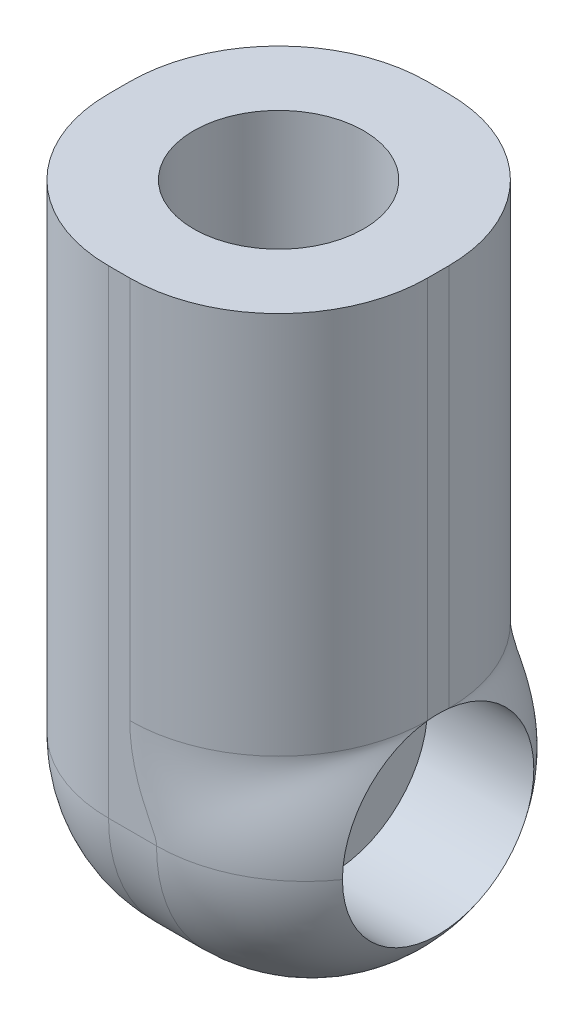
ISO-10303-21;
HEADER;
FILE_DESCRIPTION(('STEP AP214'),'2;1');
FILE_NAME('part.step','',(''),(''),'','','');
FILE_SCHEMA(('AUTOMOTIVE_DESIGN { 1 0 10303 214 1 1 1 1 }'));
ENDSEC;
DATA;
#1=APPLICATION_CONTEXT('core data for automotive mechanical design processes');
#2=APPLICATION_PROTOCOL_DEFINITION('international standard','automotive_design',2000,#1);
#3=PRODUCT_CONTEXT('',#1,'mechanical');
#4=PRODUCT('Part','Part','',(#3));
#5=PRODUCT_RELATED_PRODUCT_CATEGORY('part','',(#4));
#6=PRODUCT_DEFINITION_FORMATION('','',#4);
#7=PRODUCT_DEFINITION_CONTEXT('part definition',#1,'design');
#8=PRODUCT_DEFINITION('design','',#6,#7);
#9=PRODUCT_DEFINITION_SHAPE('','',#8);
#10=(LENGTH_UNIT() NAMED_UNIT(*) SI_UNIT(.MILLI.,.METRE.));
#11=(NAMED_UNIT(*) PLANE_ANGLE_UNIT() SI_UNIT($,.RADIAN.));
#12=(NAMED_UNIT(*) SI_UNIT($,.STERADIAN.) SOLID_ANGLE_UNIT());
#13=UNCERTAINTY_MEASURE_WITH_UNIT(LENGTH_MEASURE(1.E-05),#10,'distance_accuracy_value','');
#14=(GEOMETRIC_REPRESENTATION_CONTEXT(3) GLOBAL_UNCERTAINTY_ASSIGNED_CONTEXT((#13)) GLOBAL_UNIT_ASSIGNED_CONTEXT((#10,
#11,#12)) REPRESENTATION_CONTEXT('',''));
#15=CARTESIAN_POINT('',(0.,0.,0.));
#16=DIRECTION('',(0.,0.,1.));
#17=DIRECTION('',(1.,0.,0.));
#18=AXIS2_PLACEMENT_3D('',#15,#16,#17);
#19=CARTESIAN_POINT('',(150.,0.,0.));
#20=DIRECTION('',(-1.,0.,0.));
#21=DIRECTION('',(0.,0.,1.));
#22=AXIS2_PLACEMENT_3D('',#19,#20,#21);
#23=PLANE('',#22);
#24=DIRECTION('',(0.,0.,1.));
#25=VECTOR('',#24,1.);
#26=CARTESIAN_POINT('',(150.,300.,0.));
#27=LINE('',#26,#25);
#28=CARTESIAN_POINT('',(150.,300.,-80.));
#29=VERTEX_POINT('',#28);
#30=CARTESIAN_POINT('',(150.,300.,-70.));
#31=VERTEX_POINT('',#30);
#32=EDGE_CURVE('E175',#29,#31,#27,.T.);
#33=ORIENTED_EDGE('',*,*,#32,.T.);
#34=DIRECTION('',(0.,-1.,0.));
#35=VECTOR('',#34,1.);
#36=CARTESIAN_POINT('',(150.,0.,-70.));
#37=LINE('',#36,#35);
#38=CARTESIAN_POINT('',(150.,119.721359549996,-70.));
#39=VERTEX_POINT('',#38);
#40=EDGE_CURVE('E252',#31,#39,#37,.T.);
#41=ORIENTED_EDGE('',*,*,#40,.T.);
#42=CARTESIAN_POINT('',(150.,75.,-75.));
#43=DIRECTION('',(1.,0.,0.));
#44=DIRECTION('',(0.,0.,-1.));
#45=AXIS2_PLACEMENT_3D('',#42,#43,#44);
#46=CIRCLE('',#45,45.);
#47=CARTESIAN_POINT('',(150.,119.721359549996,-80.));
#48=VERTEX_POINT('',#47);
#49=EDGE_CURVE('E174',#48,#39,#46,.T.);
#50=ORIENTED_EDGE('',*,*,#49,.F.);
#51=DIRECTION('',(0.,1.,0.));
#52=VECTOR('',#51,1.);
#53=CARTESIAN_POINT('',(150.,0.,-80.));
#54=LINE('',#53,#52);
#55=EDGE_CURVE('E140',#48,#29,#54,.T.);
#56=ORIENTED_EDGE('',*,*,#55,.T.);
#57=EDGE_LOOP('',(#33,#41,#50,#56));
#58=FACE_BOUND('',#57,.T.);
#59=ADVANCED_FACE('F35',(#58),#23,.F.);
#60=CARTESIAN_POINT('',(0.,0.,0.));
#61=DIRECTION('',(-1.,0.,0.));
#62=DIRECTION('',(0.,0.,1.));
#63=AXIS2_PLACEMENT_3D('',#60,#61,#62);
#64=PLANE('',#63);
#65=CARTESIAN_POINT('',(0.,75.,-75.));
#66=DIRECTION('',(-1.,0.,0.));
#67=DIRECTION('',(0.,0.,1.));
#68=AXIS2_PLACEMENT_3D('',#65,#66,#67);
#69=CIRCLE('',#68,5.00000000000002);
#70=CARTESIAN_POINT('',(0.,75.,-80.));
#71=VERTEX_POINT('',#70);
#72=CARTESIAN_POINT('',(0.,75.,-70.));
#73=VERTEX_POINT('',#72);
#74=EDGE_CURVE('E283',#71,#73,#69,.T.);
#75=ORIENTED_EDGE('',*,*,#74,.T.);
#76=DIRECTION('',(0.,-1.,0.));
#77=VECTOR('',#76,1.);
#78=CARTESIAN_POINT('',(0.,300.,-70.));
#79=LINE('',#78,#77);
#80=CARTESIAN_POINT('',(0.,300.,-70.));
#81=VERTEX_POINT('',#80);
#82=EDGE_CURVE('E126',#73,#81,#79,.F.);
#83=ORIENTED_EDGE('',*,*,#82,.T.);
#84=DIRECTION('',(0.,0.,1.));
#85=VECTOR('',#84,1.);
#86=CARTESIAN_POINT('',(0.,300.,0.));
#87=LINE('',#86,#85);
#88=CARTESIAN_POINT('',(0.,300.,-80.));
#89=VERTEX_POINT('',#88);
#90=EDGE_CURVE('E170',#89,#81,#87,.T.);
#91=ORIENTED_EDGE('',*,*,#90,.F.);
#92=DIRECTION('',(0.,1.,0.));
#93=VECTOR('',#92,1.);
#94=CARTESIAN_POINT('',(0.,75.,-80.));
#95=LINE('',#94,#93);
#96=EDGE_CURVE('E151',#89,#71,#95,.F.);
#97=ORIENTED_EDGE('',*,*,#96,.T.);
#98=EDGE_LOOP('',(#75,#83,#91,#97));
#99=FACE_BOUND('',#98,.T.);
#100=ADVANCED_FACE('F288',(#99),#64,.T.);
#101=CARTESIAN_POINT('',(150.,0.,0.));
#102=DIRECTION('',(0.,0.,-1.));
#103=DIRECTION('',(-1.,0.,0.));
#104=AXIS2_PLACEMENT_3D('',#101,#102,#103);
#105=PLANE('',#104);
#106=DIRECTION('',(-1.,0.,0.));
#107=VECTOR('',#106,1.);
#108=CARTESIAN_POINT('',(150.,300.,0.));
#109=LINE('',#108,#107);
#110=CARTESIAN_POINT('',(80.,300.,0.));
#111=VERTEX_POINT('',#110);
#112=CARTESIAN_POINT('',(70.,300.,0.));
#113=VERTEX_POINT('',#112);
#114=EDGE_CURVE('E150',#111,#113,#109,.T.);
#115=ORIENTED_EDGE('',*,*,#114,.T.);
#116=DIRECTION('',(0.,-1.,0.));
#117=VECTOR('',#116,1.);
#118=CARTESIAN_POINT('',(70.,75.,0.));
#119=LINE('',#118,#117);
#120=CARTESIAN_POINT('',(70.,75.,0.));
#121=VERTEX_POINT('',#120);
#122=EDGE_CURVE('E125',#113,#121,#119,.T.);
#123=ORIENTED_EDGE('',*,*,#122,.T.);
#124=DIRECTION('',(1.,0.,0.));
#125=VECTOR('',#124,1.);
#126=CARTESIAN_POINT('',(0.,75.,0.));
#127=LINE('',#126,#125);
#128=CARTESIAN_POINT('',(92.5543735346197,75.,0.));
#129=VERTEX_POINT('',#128);
#130=EDGE_CURVE('E147',#121,#129,#127,.T.);
#131=ORIENTED_EDGE('',*,*,#130,.T.);
#132=CARTESIAN_POINT('',(150.,40.9334690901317,-45.598104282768));
#133=CARTESIAN_POINT('',(134.696267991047,48.2418132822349,0.));
#134=CARTESIAN_POINT('',(90.7955295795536,69.2067456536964,0.));
#135=CARTESIAN_POINT('',(150.,41.1227693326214,-45.3788000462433));
#136=CARTESIAN_POINT('',(134.603697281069,48.4501311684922,0.));
#137=CARTESIAN_POINT('',(90.8315374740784,69.282148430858,0.));
#138=CARTESIAN_POINT('',(150.,41.3185736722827,-45.1561854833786));
#139=CARTESIAN_POINT('',(134.510343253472,48.6633274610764,0.));
#140=CARTESIAN_POINT('',(90.8673965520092,69.3576225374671,0.));
#141=CARTESIAN_POINT('',(150.,41.724348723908,-44.7043951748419));
#142=CARTESIAN_POINT('',(134.322380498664,49.0996150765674,0.));
#143=CARTESIAN_POINT('',(90.9387682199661,69.5087352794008,0.));
#144=CARTESIAN_POINT('',(150.,41.9343195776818,-44.4752193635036));
#145=CARTESIAN_POINT('',(134.227780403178,49.3226698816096,0.));
#146=CARTESIAN_POINT('',(90.9742808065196,69.584373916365,0.));
#147=CARTESIAN_POINT('',(150.,42.3696113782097,-44.0103391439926));
#148=CARTESIAN_POINT('',(134.03742738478,49.7792432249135,0.));
#149=CARTESIAN_POINT('',(91.0449146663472,69.7358462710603,0.));
#150=CARTESIAN_POINT('',(150.,42.5949343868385,-43.7746338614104));
#151=CARTESIAN_POINT('',(133.94168264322,50.0127245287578,0.));
#152=CARTESIAN_POINT('',(91.0800358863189,69.8116800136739,0.));
#153=CARTESIAN_POINT('',(150.,43.0621793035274,-43.2968910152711));
#154=CARTESIAN_POINT('',(133.749204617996,50.4906966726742,0.));
#155=CARTESIAN_POINT('',(91.1498258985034,69.9635550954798,0.));
#156=CARTESIAN_POINT('',(150.,43.3041011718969,-43.0548534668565));
#157=CARTESIAN_POINT('',(133.652479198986,50.7351468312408,0.));
#158=CARTESIAN_POINT('',(91.1844946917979,70.0395964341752,0.));
#159=CARTESIAN_POINT('',(150.,44.0585708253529,-42.3178211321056));
#160=CARTESIAN_POINT('',(133.360748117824,51.4867354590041,0.));
#161=CARTESIAN_POINT('',(91.2879798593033,70.2686151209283,0.));
#162=CARTESIAN_POINT('',(150.,44.5982810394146,-41.8135766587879));
#163=CARTESIAN_POINT('',(133.16417524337,52.0121353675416,0.));
#164=CARTESIAN_POINT('',(91.3560208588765,70.4219442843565,0.));
#165=CARTESIAN_POINT('',(150.,45.7619151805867,-40.7839470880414));
#166=CARTESIAN_POINT('',(132.769605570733,53.1147946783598,0.));
#167=CARTESIAN_POINT('',(91.4894660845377,70.7297452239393,0.));
#168=CARTESIAN_POINT('',(150.,46.3858361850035,-40.2585627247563));
#169=CARTESIAN_POINT('',(132.57165031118,53.6916879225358,0.));
#170=CARTESIAN_POINT('',(91.5548704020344,70.8842169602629,0.));
#171=CARTESIAN_POINT('',(150.,47.40422410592,-39.4519070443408));
#172=CARTESIAN_POINT('',(132.272539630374,54.6093957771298,0.));
#173=CARTESIAN_POINT('',(91.6513689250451,71.1191448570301,0.));
#174=CARTESIAN_POINT('',(150.,47.7628840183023,-39.1760579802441));
#175=CARTESIAN_POINT('',(132.17128527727,54.928042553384,0.));
#176=CARTESIAN_POINT('',(91.6836931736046,71.1990962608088,0.));
#177=CARTESIAN_POINT('',(150.,48.5077776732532,-38.6217384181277));
#178=CARTESIAN_POINT('',(131.969608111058,55.5809604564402,0.));
#179=CARTESIAN_POINT('',(91.7473453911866,71.3593942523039,0.));
#180=CARTESIAN_POINT('',(150.,48.8940110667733,-38.3432679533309));
#181=CARTESIAN_POINT('',(131.869184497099,55.9151838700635,0.));
#182=CARTESIAN_POINT('',(91.7786733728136,71.4397408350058,0.));
#183=CARTESIAN_POINT('',(150.,49.6958998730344,-37.7852034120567));
#184=CARTESIAN_POINT('',(131.66969737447,56.5998835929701,0.));
#185=CARTESIAN_POINT('',(91.8402142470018,71.600867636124,0.));
#186=CARTESIAN_POINT('',(150.,50.1115575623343,-37.5056092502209));
#187=CARTESIAN_POINT('',(131.5706301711,56.9503170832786,0.));
#188=CARTESIAN_POINT('',(91.8704270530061,71.6816478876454,0.));
#189=CARTESIAN_POINT('',(150.,50.9740006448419,-36.9472042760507));
#190=CARTESIAN_POINT('',(131.374489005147,57.6679300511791,0.));
#191=CARTESIAN_POINT('',(91.9296005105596,71.8436646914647,0.));
#192=CARTESIAN_POINT('',(150.,51.4207854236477,-36.6683934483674));
#193=CARTESIAN_POINT('',(131.277407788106,58.0350704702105,0.));
#194=CARTESIAN_POINT('',(91.9585611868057,71.9249012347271,0.));
#195=CARTESIAN_POINT('',(150.,52.3465305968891,-36.1141283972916));
#196=CARTESIAN_POINT('',(131.0860561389,58.7860806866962,0.));
#197=CARTESIAN_POINT('',(92.0150519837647,72.0877646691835,0.));
#198=CARTESIAN_POINT('',(150.,52.8254527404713,-35.8386706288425));
#199=CARTESIAN_POINT('',(130.991771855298,59.1698985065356,0.));
#200=CARTESIAN_POINT('',(92.0425837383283,72.1693909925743,0.));
#201=CARTESIAN_POINT('',(150.,53.8172605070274,-35.2934291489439));
#202=CARTESIAN_POINT('',(130.806688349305,59.9549289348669,0.));
#203=CARTESIAN_POINT('',(92.0960957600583,72.3331522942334,0.));
#204=CARTESIAN_POINT('',(150.,54.3301463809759,-35.0236454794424));
#205=CARTESIAN_POINT('',(130.715874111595,60.3561216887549,0.));
#206=CARTESIAN_POINT('',(92.1220760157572,72.4152872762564,0.));
#207=CARTESIAN_POINT('',(150.,55.3907657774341,-34.4928463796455));
#208=CARTESIAN_POINT('',(130.538618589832,61.1759265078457,0.));
#209=CARTESIAN_POINT('',(92.1723134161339,72.5800740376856,0.));
#210=CARTESIAN_POINT('',(150.,55.9384954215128,-34.2318299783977));
#211=CARTESIAN_POINT('',(130.452157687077,61.5945304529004,0.));
#212=CARTESIAN_POINT('',(92.1965707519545,72.6627257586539,0.));
#213=CARTESIAN_POINT('',(150.,57.0692430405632,-33.722008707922));
#214=CARTESIAN_POINT('',(130.28455584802,62.4489991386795,0.));
#215=CARTESIAN_POINT('',(92.2431863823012,72.8285609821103,0.));
#216=CARTESIAN_POINT('',(150.,57.6522600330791,-33.4732034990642));
#217=CARTESIAN_POINT('',(130.203391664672,62.884874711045,0.));
#218=CARTESIAN_POINT('',(92.2655447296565,72.9117444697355,0.));
#219=CARTESIAN_POINT('',(150.,59.0604612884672,-32.9085767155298));
#220=CARTESIAN_POINT('',(130.020572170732,63.9262263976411,0.));
#221=CARTESIAN_POINT('',(92.3155280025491,73.1074187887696,0.));
#222=CARTESIAN_POINT('',(150.,59.8998391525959,-32.5992227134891));
#223=CARTESIAN_POINT('',(129.921347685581,64.5389795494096,0.));
#224=CARTESIAN_POINT('',(92.3423112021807,73.2201266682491,0.));
#225=CARTESIAN_POINT('',(150.,61.6390885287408,-32.0194715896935));
#226=CARTESIAN_POINT('',(129.736938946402,65.7926923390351,0.));
#227=CARTESIAN_POINT('',(92.3916520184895,73.4464653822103,0.));
#228=CARTESIAN_POINT('',(150.,62.538958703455,-31.7490736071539));
#229=CARTESIAN_POINT('',(129.65168243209,66.4338085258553,0.));
#230=CARTESIAN_POINT('',(92.4142097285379,73.56009619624,0.));
#231=CARTESIAN_POINT('',(150.,64.3927702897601,-31.2575078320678));
#232=CARTESIAN_POINT('',(129.497761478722,67.7406212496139,0.));
#233=CARTESIAN_POINT('',(92.4546555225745,73.7881778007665,0.));
#234=CARTESIAN_POINT('',(150.,65.3467053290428,-31.0363342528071));
#235=CARTESIAN_POINT('',(129.429022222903,68.4065596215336,0.));
#236=CARTESIAN_POINT('',(92.4725441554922,73.9026284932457,0.));
#237=CARTESIAN_POINT('',(150.,67.2987834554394,-30.6527324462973));
#238=CARTESIAN_POINT('',(129.310426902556,69.7580995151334,0.));
#239=CARTESIAN_POINT('',(92.5032601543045,74.1322115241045,0.));
#240=CARTESIAN_POINT('',(150.,68.2969263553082,-30.4903039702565));
#241=CARTESIAN_POINT('',(129.260505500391,70.444032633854,0.));
#242=CARTESIAN_POINT('',(92.516087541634,74.2473438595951,0.));
#243=CARTESIAN_POINT('',(150.,70.3114394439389,-30.2335467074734));
#244=CARTESIAN_POINT('',(129.181858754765,71.8206898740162,0.));
#245=CARTESIAN_POINT('',(92.5362451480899,74.4766564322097,0.));
#246=CARTESIAN_POINT('',(150.,71.3274313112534,-30.1384002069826));
#247=CARTESIAN_POINT('',(129.152832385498,72.5116326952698,0.));
#248=CARTESIAN_POINT('',(92.5436414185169,74.5908308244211,0.));
#249=CARTESIAN_POINT('',(150.,73.3738729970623,-30.0177139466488));
#250=CARTESIAN_POINT('',(129.116065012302,73.8995004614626,0.));
#251=CARTESIAN_POINT('',(92.5530083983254,74.8194021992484,0.));
#252=CARTESIAN_POINT('',(150.,74.40432258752,-29.9921730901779));
#253=CARTESIAN_POINT('',(129.108300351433,74.5968614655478,0.));
#254=CARTESIAN_POINT('',(92.5549791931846,74.9337991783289,0.));
#255=CARTESIAN_POINT('',(150.,76.4628221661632,-30.012004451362));
#256=CARTESIAN_POINT('',(129.11433330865,75.9900678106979,0.));
#257=CARTESIAN_POINT('',(92.5534446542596,75.1625547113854,0.));
#258=CARTESIAN_POINT('',(150.,77.4908721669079,-30.0573762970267));
#259=CARTESIAN_POINT('',(129.1281347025,76.6863621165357,0.));
#260=CARTESIAN_POINT('',(92.5499393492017,75.2769132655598,0.));
#261=CARTESIAN_POINT('',(150.,79.527995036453,-30.2167327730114));
#262=CARTESIAN_POINT('',(129.176737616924,78.0700995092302,0.));
#263=CARTESIAN_POINT('',(92.5375417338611,75.5053433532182,0.));
#264=CARTESIAN_POINT('',(150.,80.5370671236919,-30.3307202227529));
#265=CARTESIAN_POINT('',(129.211570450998,78.7579687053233,0.));
#266=CARTESIAN_POINT('',(92.5286492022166,75.6194148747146,0.));
#267=CARTESIAN_POINT('',(150.,82.1706022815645,-30.5702365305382));
#268=CARTESIAN_POINT('',(129.285080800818,79.87746949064,0.));
#269=CARTESIAN_POINT('',(92.509756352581,75.8068026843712,0.));
#270=CARTESIAN_POINT('',(150.,82.8049571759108,-30.6774493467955));
#271=CARTESIAN_POINT('',(129.318077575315,80.3140415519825,0.));
#272=CARTESIAN_POINT('',(92.5012582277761,75.8802747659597,0.));
#273=CARTESIAN_POINT('',(150.,84.0561571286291,-30.9160869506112));
#274=CARTESIAN_POINT('',(129.391786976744,81.179199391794,0.));
#275=CARTESIAN_POINT('',(92.4821878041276,76.0269516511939,0.));
#276=CARTESIAN_POINT('',(150.,84.6730017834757,-31.0475122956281));
#277=CARTESIAN_POINT('',(129.432516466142,81.6078730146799,0.));
#278=CARTESIAN_POINT('',(92.4716154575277,76.1001564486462,0.));
#279=CARTESIAN_POINT('',(150.,85.8863513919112,-31.3322103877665));
#280=CARTESIAN_POINT('',(129.521122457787,82.4558878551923,0.));
#281=CARTESIAN_POINT('',(92.4484930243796,76.2462585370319,0.));
#282=CARTESIAN_POINT('',(150.,86.4828545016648,-31.4854851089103));
#283=CARTESIAN_POINT('',(129.569017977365,82.8753022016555,0.));
#284=CARTESIAN_POINT('',(92.4359427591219,76.3191557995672,0.));
#285=CARTESIAN_POINT('',(150.,87.6532294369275,-31.8112885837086));
#286=CARTESIAN_POINT('',(129.671322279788,83.7036385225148,0.));
#287=CARTESIAN_POINT('',(92.4089736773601,76.4646026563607,0.));
#288=CARTESIAN_POINT('',(150.,88.2271013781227,-31.9838172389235));
#289=CARTESIAN_POINT('',(129.725750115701,84.1126198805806,0.));
#290=CARTESIAN_POINT('',(92.3945548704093,76.5371522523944,0.));
#291=CARTESIAN_POINT('',(150.,89.3510006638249,-32.3456026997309));
#292=CARTESIAN_POINT('',(129.840502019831,84.9195095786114,0.));
#293=CARTESIAN_POINT('',(92.3639522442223,76.6819343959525,0.));
#294=CARTESIAN_POINT('',(150.,89.90100971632,-32.5348720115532));
#295=CARTESIAN_POINT('',(129.900849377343,85.3174536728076,0.));
#296=CARTESIAN_POINT('',(92.3477671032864,76.7541666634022,0.));
#297=CARTESIAN_POINT('',(150.,90.9756496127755,-32.9273736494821));
#298=CARTESIAN_POINT('',(130.026734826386,86.1012874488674,0.));
#299=CARTESIAN_POINT('',(92.3137594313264,76.8982439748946,0.));
#300=CARTESIAN_POINT('',(150.,91.5002804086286,-33.1306060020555));
#301=CARTESIAN_POINT('',(130.092290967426,86.487208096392,0.));
#302=CARTESIAN_POINT('',(92.2959368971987,76.9700890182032,0.));
#303=CARTESIAN_POINT('',(150.,92.5235739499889,-33.5484642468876));
#304=CARTESIAN_POINT('',(130.227929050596,87.246525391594,0.));
#305=CARTESIAN_POINT('',(92.2587744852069,77.1133813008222,0.));
#306=CARTESIAN_POINT('',(150.,93.0222378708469,-33.7630896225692));
#307=CARTESIAN_POINT('',(130.298027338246,87.6199409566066,0.));
#308=CARTESIAN_POINT('',(92.2394346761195,77.1848285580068,0.));
#309=CARTESIAN_POINT('',(150.,93.9935127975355,-34.2013436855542));
#310=CARTESIAN_POINT('',(130.442116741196,88.3540121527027,0.));
#311=CARTESIAN_POINT('',(92.1993536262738,77.3273302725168,0.));
#312=CARTESIAN_POINT('',(150.,94.4661230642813,-34.4249726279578));
#313=CARTESIAN_POINT('',(130.516122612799,88.7146745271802,0.));
#314=CARTESIAN_POINT('',(92.1786123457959,77.3983847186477,0.));
#315=CARTESIAN_POINT('',(150.,95.3906040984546,-34.8815249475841));
#316=CARTESIAN_POINT('',(130.668259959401,89.4270521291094,0.));
#317=CARTESIAN_POINT('',(92.1356056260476,77.5408886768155,0.));
#318=CARTESIAN_POINT('',(150.,95.8421874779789,-35.1145237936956));
#319=CARTESIAN_POINT('',(130.746439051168,89.7786130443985,0.));
#320=CARTESIAN_POINT('',(92.1133258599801,77.612333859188,0.));
#321=CARTESIAN_POINT('',(150.,96.7195215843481,-35.5854073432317));
#322=CARTESIAN_POINT('',(130.905580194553,90.4686158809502,0.));
#323=CARTESIAN_POINT('',(92.0675615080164,77.7548379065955,0.));
#324=CARTESIAN_POINT('',(150.,97.1452717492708,-35.823292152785));
#325=CARTESIAN_POINT('',(130.986552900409,90.8070466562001,0.));
#326=CARTESIAN_POINT('',(92.0440768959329,77.8258967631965,0.));
#327=CARTESIAN_POINT('',(150.,98.384890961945,-36.5414489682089));
#328=CARTESIAN_POINT('',(131.233105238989,91.80397834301,0.));
#329=CARTESIAN_POINT('',(91.9719777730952,78.0385106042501,0.));
#330=CARTESIAN_POINT('',(150.,99.1611668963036,-37.0262425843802));
#331=CARTESIAN_POINT('',(131.401807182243,92.4417451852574,0.));
#332=CARTESIAN_POINT('',(91.9217161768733,78.1795087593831,0.));
#333=CARTESIAN_POINT('',(150.,100.621348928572,-37.9957531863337));
#334=CARTESIAN_POINT('',(131.744375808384,93.6673747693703,0.));
#335=CARTESIAN_POINT('',(91.8175889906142,78.4601072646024,0.));
#336=CARTESIAN_POINT('',(150.,101.305283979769,-38.4804701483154));
#337=CARTESIAN_POINT('',(131.918271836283,94.2550392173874,0.));
#338=CARTESIAN_POINT('',(91.7637245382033,78.5997080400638,0.));
#339=CARTESIAN_POINT('',(150.,102.590555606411,-39.4415271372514));
#340=CARTESIAN_POINT('',(132.268395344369,95.3838325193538,0.));
#341=CARTESIAN_POINT('',(91.653030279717,78.8777244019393,0.));
#342=CARTESIAN_POINT('',(150.,103.191892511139,-39.917867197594));
#343=CARTESIAN_POINT('',(132.444625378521,95.9247115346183,0.));
#344=CARTESIAN_POINT('',(91.5962004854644,79.0161399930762,0.));
#345=CARTESIAN_POINT('',(150.,104.38034187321,-40.9052309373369));
#346=CARTESIAN_POINT('',(132.815624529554,97.0177617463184,0.));
#347=CARTESIAN_POINT('',(91.4740860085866,79.3063142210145,0.));
#348=CARTESIAN_POINT('',(150.,104.959452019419,-41.4147008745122));
#349=CARTESIAN_POINT('',(133.010288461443,97.5646131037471,0.));
#350=CARTESIAN_POINT('',(91.4085371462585,79.4579613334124,0.));
#351=CARTESIAN_POINT('',(150.,106.040798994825,-42.4115174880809));
#352=CARTESIAN_POINT('',(133.397507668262,98.6106557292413,0.));
#353=CARTESIAN_POINT('',(91.2751193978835,79.7602289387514,0.));
#354=CARTESIAN_POINT('',(150.,106.543035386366,-42.8988640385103));
#355=CARTESIAN_POINT('',(133.590015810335,99.1095051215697,0.));
#356=CARTESIAN_POINT('',(91.2072504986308,79.910849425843,0.));
#357=CARTESIAN_POINT('',(150.,107.481576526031,-43.8488706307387));
#358=CARTESIAN_POINT('',(133.971358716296,100.064170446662,0.));
#359=CARTESIAN_POINT('',(91.0697013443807,80.2112563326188,0.));
#360=CARTESIAN_POINT('',(150.,107.917882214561,-44.3115310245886));
#361=CARTESIAN_POINT('',(134.16013342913,100.519669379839,0.));
#362=CARTESIAN_POINT('',(91.0000211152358,80.3610427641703,0.));
#363=CARTESIAN_POINT('',(150.,108.734160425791,-45.2111574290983));
#364=CARTESIAN_POINT('',(134.532946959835,101.39196613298,0.));
#365=CARTESIAN_POINT('',(90.8592658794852,80.6599568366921,0.));
#366=CARTESIAN_POINT('',(150.,109.114133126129,-45.648123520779));
#367=CARTESIAN_POINT('',(134.71691906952,101.808476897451,0.));
#368=CARTESIAN_POINT('',(90.7881908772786,80.8090844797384,0.));
#369=CARTESIAN_POINT('',(150.,109.824119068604,-46.494142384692));
#370=CARTESIAN_POINT('',(135.078477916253,102.604631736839,0.));
#371=CARTESIAN_POINT('',(90.6453677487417,81.1060471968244,0.));
#372=CARTESIAN_POINT('',(150.,110.154385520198,-46.9033303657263));
#373=CARTESIAN_POINT('',(135.256029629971,102.984216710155,0.));
#374=CARTESIAN_POINT('',(90.5736251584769,81.2538849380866,0.));
#375=CARTESIAN_POINT('',(150.,110.774261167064,-47.6969667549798));
#376=CARTESIAN_POINT('',(135.605360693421,103.712504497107,0.));
#377=CARTESIAN_POINT('',(90.4293802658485,81.5491885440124,0.));
#378=CARTESIAN_POINT('',(150.,111.063870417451,-48.0814151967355));
#379=CARTESIAN_POINT('',(135.777073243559,104.06098704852,0.));
#380=CARTESIAN_POINT('',(90.3568779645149,81.6966544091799,0.));
#381=CARTESIAN_POINT('',(150.,111.608302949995,-48.8266342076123));
#382=CARTESIAN_POINT('',(136.114523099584,104.730213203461,0.));
#383=CARTESIAN_POINT('',(90.2113460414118,81.9913289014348,0.));
#384=CARTESIAN_POINT('',(150.,111.863125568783,-49.1874043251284));
#385=CARTESIAN_POINT('',(136.280196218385,105.050764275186,0.));
#386=CARTESIAN_POINT('',(90.1383164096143,82.1385375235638,0.));
#387=CARTESIAN_POINT('',(150.,112.222965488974,-49.7117500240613));
#388=CARTESIAN_POINT('',(136.523940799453,105.51241821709,0.));
#389=CARTESIAN_POINT('',(90.0285238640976,82.359227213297,0.));
#390=CARTESIAN_POINT('',(150.,112.339179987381,-49.8837306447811));
#391=CARTESIAN_POINT('',(136.604501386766,105.663299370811,0.));
#392=CARTESIAN_POINT('',(89.9918849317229,82.4327700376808,0.));
#393=CARTESIAN_POINT('',(150.,112.564676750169,-50.2222592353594));
#394=CARTESIAN_POINT('',(136.764108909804,105.959111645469,0.));
#395=CARTESIAN_POINT('',(89.9185454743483,82.5798249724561,0.));
#396=CARTESIAN_POINT('',(150.,112.673959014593,-50.3888072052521));
#397=CARTESIAN_POINT('',(136.84314858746,106.104023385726,0.));
#398=CARTESIAN_POINT('',(89.8818449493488,82.6533370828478,0.));
#399=CARTESIAN_POINT('',(150.,112.992984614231,-50.8818116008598));
#400=CARTESIAN_POINT('',(137.078822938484,106.531775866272,0.));
#401=CARTESIAN_POINT('',(89.771401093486,82.8744034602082,0.));
#402=CARTESIAN_POINT('',(150.,113.192998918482,-51.2002968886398));
#403=CARTESIAN_POINT('',(137.232914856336,106.80556421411,0.));
#404=CARTESIAN_POINT('',(89.697595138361,83.021926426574,0.));
#405=CARTESIAN_POINT('',(150.,113.570731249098,-51.8174752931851));
#406=CARTESIAN_POINT('',(137.53516644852,107.332702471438,0.));
#407=CARTESIAN_POINT('',(89.5499592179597,83.3169603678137,0.));
#408=CARTESIAN_POINT('',(150.,113.748449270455,-52.1161684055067));
#409=CARTESIAN_POINT('',(137.683274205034,107.585926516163,0.));
#410=CARTESIAN_POINT('',(89.476129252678,83.4644713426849,0.));
#411=CARTESIAN_POINT('',(150.,114.084596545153,-52.6951496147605));
#412=CARTESIAN_POINT('',(137.973720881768,108.073897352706,0.));
#413=CARTESIAN_POINT('',(89.3285662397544,83.7595419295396,0.));
#414=CARTESIAN_POINT('',(150.,114.243025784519,-52.9754376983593));
#415=CARTESIAN_POINT('',(138.116012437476,108.308535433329,0.));
#416=CARTESIAN_POINT('',(89.2548331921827,83.9071015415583,0.));
#417=CARTESIAN_POINT('',(150.,114.543145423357,-53.5189393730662));
#418=CARTESIAN_POINT('',(138.395021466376,108.761074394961,0.));
#419=CARTESIAN_POINT('',(89.1075681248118,84.2023210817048,0.));
#420=CARTESIAN_POINT('',(150.,114.684835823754,-53.7821529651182));
#421=CARTESIAN_POINT('',(138.53169593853,108.978881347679,0.));
#422=CARTESIAN_POINT('',(89.0340361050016,84.3499810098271,0.));
#423=CARTESIAN_POINT('',(150.,114.953643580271,-54.2927638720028));
#424=CARTESIAN_POINT('',(138.799684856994,109.39930277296,0.));
#425=CARTESIAN_POINT('',(88.8872635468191,84.6454444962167,0.));
#426=CARTESIAN_POINT('',(150.,115.08076103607,-54.5401612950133));
#427=CARTESIAN_POINT('',(138.930960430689,109.601836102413,0.));
#428=CARTESIAN_POINT('',(88.8140230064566,84.7932480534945,0.));
#429=CARTESIAN_POINT('',(150.,115.322254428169,-55.0203146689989));
#430=CARTESIAN_POINT('',(139.188376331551,109.993074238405,0.));
#431=CARTESIAN_POINT('',(88.6679105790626,85.0890372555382,0.));
#432=CARTESIAN_POINT('',(150.,115.43663036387,-55.2530706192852));
#433=CARTESIAN_POINT('',(139.314481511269,110.181708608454,0.));
#434=CARTESIAN_POINT('',(88.5950386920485,85.2370229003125,0.));
#435=CARTESIAN_POINT('',(150.,115.763068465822,-55.931042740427));
#436=CARTESIAN_POINT('',(139.685941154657,110.729485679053,0.));
#437=CARTESIAN_POINT('',(88.3770806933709,85.6813026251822,0.));
#438=CARTESIAN_POINT('',(150.,115.958441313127,-56.3559639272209));
#439=CARTESIAN_POINT('',(139.923257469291,111.06867397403,0.));
#440=CARTESIAN_POINT('',(88.2326520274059,85.9779199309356,0.));
#441=CARTESIAN_POINT('',(150.,116.314717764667,-57.1594188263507));
#442=CARTESIAN_POINT('',(140.380166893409,111.705188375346,0.));
#443=CARTESIAN_POINT('',(87.9460223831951,86.5721752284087,0.));
#444=CARTESIAN_POINT('',(150.,116.475626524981,-57.5379594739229));
#445=CARTESIAN_POINT('',(140.599557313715,112.002151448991,0.));
#446=CARTESIAN_POINT('',(87.8038210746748,86.8698130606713,0.));
#447=CARTESIAN_POINT('',(150.,116.77037185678,-58.2552611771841));
#448=CARTESIAN_POINT('',(141.022338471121,112.560781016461,0.));
#449=CARTESIAN_POINT('',(87.5219754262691,87.466298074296,0.));
#450=CARTESIAN_POINT('',(150.,116.904208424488,-58.5940222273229));
#451=CARTESIAN_POINT('',(141.225562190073,112.822164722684,0.));
#452=CARTESIAN_POINT('',(87.3823310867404,87.7651452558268,0.));
#453=CARTESIAN_POINT('',(150.,117.150381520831,-59.2372676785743));
#454=CARTESIAN_POINT('',(141.617562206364,113.314927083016,0.));
#455=CARTESIAN_POINT('',(87.105879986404,88.3641554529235,0.));
#456=CARTESIAN_POINT('',(150.,117.262717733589,-59.5417515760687));
#457=CARTESIAN_POINT('',(141.806202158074,113.546087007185,0.));
#458=CARTESIAN_POINT('',(86.9690732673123,88.6643184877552,0.));
#459=CARTESIAN_POINT('',(150.,117.470123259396,-60.1210491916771));
#460=CARTESIAN_POINT('',(142.170431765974,113.982703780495,0.));
#461=CARTESIAN_POINT('',(86.6985292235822,89.2660254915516,0.));
#462=CARTESIAN_POINT('',(150.,117.565192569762,-60.3958629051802));
#463=CARTESIAN_POINT('',(142.34591001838,114.18799061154,0.));
#464=CARTESIAN_POINT('',(86.5647918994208,89.567569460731,0.));
#465=CARTESIAN_POINT('',(150.,117.741413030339,-60.9199421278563));
#466=CARTESIAN_POINT('',(142.685229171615,114.576585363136,0.));
#467=CARTESIAN_POINT('',(86.3004534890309,90.1723642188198,0.));
#468=CARTESIAN_POINT('',(150.,117.822551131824,-61.1691835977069));
#469=CARTESIAN_POINT('',(142.848966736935,114.759738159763,0.));
#470=CARTESIAN_POINT('',(86.1698554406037,90.4756163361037,0.));
#471=CARTESIAN_POINT('',(150.,117.973352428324,-61.6451044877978));
#472=CARTESIAN_POINT('',(143.16574461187,115.106784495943,0.));
#473=CARTESIAN_POINT('',(85.9120842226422,91.0835732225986,0.));
#474=CARTESIAN_POINT('',(150.,118.043015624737,-61.8717839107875));
#475=CARTESIAN_POINT('',(143.318709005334,115.270571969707,0.));
#476=CARTESIAN_POINT('',(85.7849110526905,91.3882779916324,0.));
#477=CARTESIAN_POINT('',(150.,118.172874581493,-62.3053526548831));
#478=CARTESIAN_POINT('',(143.614934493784,115.581341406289,0.));
#479=CARTESIAN_POINT('',(85.5341261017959,91.999146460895,0.));
#480=CARTESIAN_POINT('',(150.,118.233070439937,-62.5122421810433));
#481=CARTESIAN_POINT('',(143.7581326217,115.728238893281,0.));
#482=CARTESIAN_POINT('',(85.4105142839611,92.3053101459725,0.));
#483=CARTESIAN_POINT('',(150.,118.345590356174,-62.9085899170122));
#484=CARTESIAN_POINT('',(144.035710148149,116.007291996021,0.));
#485=CARTESIAN_POINT('',(85.1669665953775,92.91909661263,0.));
#486=CARTESIAN_POINT('',(150.,118.397914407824,-63.098048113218));
#487=CARTESIAN_POINT('',(144.170036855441,116.139379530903,0.));
#488=CARTESIAN_POINT('',(85.0470307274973,93.2267193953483,0.));
#489=CARTESIAN_POINT('',(150.,118.495988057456,-63.4616081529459));
#490=CARTESIAN_POINT('',(144.430700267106,116.390601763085,0.));
#491=CARTESIAN_POINT('',(84.8108960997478,93.8435144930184,0.));
#492=CARTESIAN_POINT('',(150.,118.541735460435,-63.6357048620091));
#493=CARTESIAN_POINT('',(144.556989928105,116.509676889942,0.));
#494=CARTESIAN_POINT('',(84.6946985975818,94.1526872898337,0.));
#495=CARTESIAN_POINT('',(150.,118.627662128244,-63.9701860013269));
#496=CARTESIAN_POINT('',(144.802221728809,116.736297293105,0.));
#497=CARTESIAN_POINT('',(84.4661700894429,94.7724590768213,0.));
#498=CARTESIAN_POINT('',(150.,118.667841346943,-64.1305703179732));
#499=CARTESIAN_POINT('',(144.921126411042,116.843797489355,0.));
#500=CARTESIAN_POINT('',(84.3538391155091,95.0830580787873,0.));
#501=CARTESIAN_POINT('',(150.,118.781337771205,-64.5934562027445));
#502=CARTESIAN_POINT('',(145.268140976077,117.151295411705,0.));
#503=CARTESIAN_POINT('',(84.022756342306,96.016980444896,0.));
#504=CARTESIAN_POINT('',(150.,118.847611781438,-64.8776832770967));
#505=CARTESIAN_POINT('',(145.485650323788,117.335440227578,0.));
#506=CARTESIAN_POINT('',(83.8099196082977,96.6424163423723,0.));
#507=CARTESIAN_POINT('',(150.,118.952871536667,-65.3465912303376));
#508=CARTESIAN_POINT('',(145.850889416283,117.632696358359,0.));
#509=CARTESIAN_POINT('',(83.4472724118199,97.7552455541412,0.));
#510=CARTESIAN_POINT('',(150.,118.994633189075,-65.5391869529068));
#511=CARTESIAN_POINT('',(146.003231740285,117.752414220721,0.));
#512=CARTESIAN_POINT('',(83.2941633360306,98.2415684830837,0.));
#513=CARTESIAN_POINT('',(150.,119.071601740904,-65.9044592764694));
#514=CARTESIAN_POINT('',(146.295991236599,117.975241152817,0.));
#515=CARTESIAN_POINT('',(82.9978513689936,99.2172351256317,0.));
#516=CARTESIAN_POINT('',(150.,119.106808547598,-66.0771355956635));
#517=CARTESIAN_POINT('',(146.436340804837,118.078280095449,0.));
#518=CARTESIAN_POINT('',(82.8546486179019,99.7065788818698,0.));
#519=CARTESIAN_POINT('',(150.,119.171945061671,-66.4053970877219));
#520=CARTESIAN_POINT('',(146.706444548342,118.270121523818,0.));
#521=CARTESIAN_POINT('',(82.5783187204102,100.688122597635,0.));
#522=CARTESIAN_POINT('',(150.,119.201874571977,-66.560981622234));
#523=CARTESIAN_POINT('',(146.836144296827,118.358870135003,0.));
#524=CARTESIAN_POINT('',(82.4451919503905,101.180322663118,0.));
#525=CARTESIAN_POINT('',(150.,119.257431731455,-66.8573680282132));
#526=CARTESIAN_POINT('',(147.086066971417,118.524060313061,0.));
#527=CARTESIAN_POINT('',(82.1891638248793,102.167386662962,0.));
#528=CARTESIAN_POINT('',(150.,119.283059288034,-66.9981695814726));
#529=CARTESIAN_POINT('',(147.206245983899,118.600460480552,0.));
#530=CARTESIAN_POINT('',(82.0662626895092,102.662250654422,0.));
#531=CARTESIAN_POINT('',(150.,119.330781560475,-67.266926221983));
#532=CARTESIAN_POINT('',(147.438097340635,118.742567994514,0.));
#533=CARTESIAN_POINT('',(81.830806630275,103.654482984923,0.));
#534=CARTESIAN_POINT('',(150.,119.352875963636,-67.3948801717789));
#535=CARTESIAN_POINT('',(147.549733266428,118.808242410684,0.));
#536=CARTESIAN_POINT('',(81.7182526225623,104.151851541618,0.));
#537=CARTESIAN_POINT('',(150.,119.39412988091,-67.639527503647));
#538=CARTESIAN_POINT('',(147.765306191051,118.930224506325,0.));
#539=CARTESIAN_POINT('',(81.5036138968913,105.14884563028,0.));
#540=CARTESIAN_POINT('',(150.,119.413289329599,-67.7562206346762));
#541=CARTESIAN_POINT('',(147.869213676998,118.986506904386,0.));
#542=CARTESIAN_POINT('',(81.4015294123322,105.648471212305,0.));
#543=CARTESIAN_POINT('',(150.,119.467113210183,-68.0914911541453));
#544=CARTESIAN_POINT('',(148.17071505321,119.14317283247,0.));
#545=CARTESIAN_POINT('',(81.1111393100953,107.150387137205,0.));
#546=CARTESIAN_POINT('',(150.,119.498126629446,-68.2952795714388));
#547=CARTESIAN_POINT('',(148.357494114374,119.231026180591,0.));
#548=CARTESIAN_POINT('',(80.9386791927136,108.15579181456,0.));
#549=CARTESIAN_POINT('',(150.,119.553661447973,-68.6747918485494));
#550=CARTESIAN_POINT('',(148.710555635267,119.382292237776,0.));
#551=CARTESIAN_POINT('',(80.6344139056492,110.188239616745,0.));
#552=CARTESIAN_POINT('',(150.,119.578077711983,-68.8500453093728));
#553=CARTESIAN_POINT('',(148.87633837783,119.445209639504,0.));
#554=CARTESIAN_POINT('',(80.5032621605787,111.21538019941,0.));
#555=CARTESIAN_POINT('',(150.,119.621725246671,-69.1751832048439));
#556=CARTESIAN_POINT('',(149.18768817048,119.550107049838,0.));
#557=CARTESIAN_POINT('',(80.2856917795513,113.274394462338,0.));
#558=CARTESIAN_POINT('',(150.,119.640956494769,-69.3250675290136));
#559=CARTESIAN_POINT('',(149.333154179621,119.592020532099,0.));
#560=CARTESIAN_POINT('',(80.1992733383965,114.306268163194,0.));
#561=CARTESIAN_POINT('',(150.,119.675577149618,-69.604394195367));
#562=CARTESIAN_POINT('',(149.606757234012,119.659035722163,0.));
#563=CARTESIAN_POINT('',(80.0715051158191,116.373217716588,0.));
#564=CARTESIAN_POINT('',(150.,119.69096514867,-69.7338290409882));
#565=CARTESIAN_POINT('',(149.734814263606,119.684088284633,0.));
#566=CARTESIAN_POINT('',(80.0301718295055,117.40829460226,0.));
#567=CARTESIAN_POINT('',(150.,119.711856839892,-69.9153636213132));
#568=CARTESIAN_POINT('',(149.915435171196,119.711392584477,0.));
#569=CARTESIAN_POINT('',(80.0021823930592,118.96146178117,0.));
#570=CARTESIAN_POINT('',(150.,119.718455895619,-69.9737741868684));
#571=CARTESIAN_POINT('',(149.973761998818,119.71878225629,0.));
#572=CARTESIAN_POINT('',(79.998521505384,119.479295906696,0.));
#573=CARTESIAN_POINT('',(150.,119.731010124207,-70.0867575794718));
#574=CARTESIAN_POINT('',(150.086841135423,119.730452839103,0.));
#575=CARTESIAN_POINT('',(80.0025514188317,120.514921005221,0.));
#576=CARTESIAN_POINT('',(150.,119.736965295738,-70.1413303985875));
#577=CARTESIAN_POINT('',(150.141587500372,119.734730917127,0.));
#578=CARTESIAN_POINT('',(80.0102422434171,121.03271197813,0.));
#579=CARTESIAN_POINT('',(150.,119.742641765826,-70.1941693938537));
#580=CARTESIAN_POINT('',(150.194643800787,119.737613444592,0.));
#581=CARTESIAN_POINT('',(80.0236153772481,121.550373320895,0.));
#582=(BOUNDED_SURFACE() B_SPLINE_SURFACE(3,2,((#132,#133,#134),(#135,#136,#137),(#138,#139,
#140),(#141,#142,#143),(#144,#145,#146),(#147,#148,#149),(#150,#151,#152),(#153,#154,#155),
(#156,#157,#158),(#159,#160,#161),(#162,#163,#164),(#165,#166,#167),(#168,#169,#170),(#171,#172,
#173),(#174,#175,#176),(#177,#178,#179),(#180,#181,#182),(#183,#184,#185),(#186,#187,#188),
(#189,#190,#191),(#192,#193,#194),(#195,#196,#197),(#198,#199,#200),(#201,#202,#203),(#204,#205,
#206),(#207,#208,#209),(#210,#211,#212),(#213,#214,#215),(#216,#217,#218),(#219,#220,#221),
(#222,#223,#224),(#225,#226,#227),(#228,#229,#230),(#231,#232,#233),(#234,#235,#236),(#237,#238,
#239),(#240,#241,#242),(#243,#244,#245),(#246,#247,#248),(#249,#250,#251),(#252,#253,#254),
(#255,#256,#257),(#258,#259,#260),(#261,#262,#263),(#264,#265,#266),(#267,#268,#269),(#270,#271,
#272),(#273,#274,#275),(#276,#277,#278),(#279,#280,#281),(#282,#283,#284),(#285,#286,#287),
(#288,#289,#290),(#291,#292,#293),(#294,#295,#296),(#297,#298,#299),(#300,#301,#302),(#303,#304,
#305),(#306,#307,#308),(#309,#310,#311),(#312,#313,#314),(#315,#316,#317),(#318,#319,#320),
(#321,#322,#323),(#324,#325,#326),(#327,#328,#329),(#330,#331,#332),(#333,#334,#335),(#336,#337,
#338),(#339,#340,#341),(#342,#343,#344),(#345,#346,#347),(#348,#349,#350),(#351,#352,#353),
(#354,#355,#356),(#357,#358,#359),(#360,#361,#362),(#363,#364,#365),(#366,#367,#368),(#369,#370,
#371),(#372,#373,#374),(#375,#376,#377),(#378,#379,#380),(#381,#382,#383),(#384,#385,#386),
(#387,#388,#389),(#390,#391,#392),(#393,#394,#395),(#396,#397,#398),(#399,#400,#401),(#402,#403,
#404),(#405,#406,#407),(#408,#409,#410),(#411,#412,#413),(#414,#415,#416),(#417,#418,#419),
(#420,#421,#422),(#423,#424,#425),(#426,#427,#428),(#429,#430,#431),(#432,#433,#434),(#435,#436,
#437),(#438,#439,#440),(#441,#442,#443),(#444,#445,#446),(#447,#448,#449),(#450,#451,#452),
(#453,#454,#455),(#456,#457,#458),(#459,#460,#461),(#462,#463,#464),(#465,#466,#467),(#468,#469,
#470),(#471,#472,#473),(#474,#475,#476),(#477,#478,#479),(#480,#481,#482),(#483,#484,#485),
(#486,#487,#488),(#489,#490,#491),(#492,#493,#494),(#495,#496,#497),(#498,#499,#500),(#501,#502,
#503),(#504,#505,#506),(#507,#508,#509),(#510,#511,#512),(#513,#514,#515),(#516,#517,#518),
(#519,#520,#521),(#522,#523,#524),(#525,#526,#527),(#528,#529,#530),(#531,#532,#533),(#534,#535,
#536),(#537,#538,#539),(#540,#541,#542),(#543,#544,#545),(#546,#547,#548),(#549,#550,#551),
(#552,#553,#554),(#555,#556,#557),(#558,#559,#560),(#561,#562,#563),(#564,#565,#566),(#567,#568,
#569),(#570,#571,#572),(#573,#574,#575),(#576,#577,#578),(#579,#580,#581)),.UNSPECIFIED.,.F.,
.F.,.F.) B_SPLINE_SURFACE_WITH_KNOTS((4,2,2,2,2,2,2,2,2,2,2,2,2,2,2,2,2,2,2,2,2,2,2,2,2,2,2,2,2,
2,2,2,2,2,2,2,2,2,2,2,2,2,2,2,2,2,2,2,2,2,2,2,2,2,2,2,2,2,2,2,2,2,2,2,2,2,2,2,2,2,2,2,2,2,4),(3,
3),(0.,0.250677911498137,0.501358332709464,0.752072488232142,1.00278604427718,1.50601124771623,
2.00921899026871,2.26792912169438,2.52663597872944,2.78536287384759,3.04408466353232,
3.30250379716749,3.56092484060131,3.81931716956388,4.07770230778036,4.42516653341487,
4.77262308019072,5.12003875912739,5.46745296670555,5.81056871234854,6.15367905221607,
6.49678759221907,6.83991023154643,7.06176871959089,7.28363231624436,7.50551597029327,
7.72739848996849,7.94944819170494,8.17149831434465,8.39353837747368,8.61558473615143,
8.84008833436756,9.06459681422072,9.51359527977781,9.96245263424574,10.4113081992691,
10.906905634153,11.4025058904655,11.8980990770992,12.3936907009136,12.8866654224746,
13.3796394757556,13.8726229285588,14.1191155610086,14.3656081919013,14.8604749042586,
15.3553417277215,15.8502089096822,16.3450760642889,16.8399398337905,17.334803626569,
18.3245297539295,19.3141077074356,20.3036857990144,21.2932784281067,22.2828712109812,
23.2733859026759,24.2639004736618,25.2544047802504,26.2449098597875,27.2357447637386,
28.2265878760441,30.2083152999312,31.7377859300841,33.2672781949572,34.7968275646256,
36.326409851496,37.8561274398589,39.3858791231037,42.4451509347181,45.5506319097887,
48.6561264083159,51.7627567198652,53.3161903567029,54.8696272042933),(0.,1.),
.UNSPECIFIED.) GEOMETRIC_REPRESENTATION_ITEM() RATIONAL_B_SPLINE_SURFACE(((1.,0.8211572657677,
1.),(1.,0.822111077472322,1.),(1.,0.823077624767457,1.),(1.,0.825035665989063,1.),(1.,
0.826027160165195,1.),(1.,0.828034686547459,1.),(1.,0.829050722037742,1.),(1.,0.831106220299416,
1.),(1.,0.832145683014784,1.),(1.,0.835304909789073,1.),(1.,0.837458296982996,1.),(1.,
0.84183779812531,1.),(1.,0.844063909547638,1.),(1.,0.847467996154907,1.),(1.,0.84862970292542,
1.),(1.,0.850959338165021,1.),(1.,0.852127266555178,1.),(1.,0.854463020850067,1.),(1.,
0.855630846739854,1.),(1.,0.857958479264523,1.),(1.,0.859118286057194,1.),(1.,0.861419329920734,
1.),(1.,0.86256058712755,1.),(1.,0.864815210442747,1.),(1.,0.865928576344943,1.),(1.,
0.868115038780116,1.),(1.,0.869188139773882,1.),(1.,0.871280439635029,1.),(1.,0.87229964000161,
1.),(1.,0.874608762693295,1.),(1.,0.87587088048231,1.),(1.,0.87823168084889,1.),(1.,
0.87933036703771,1.),(1.,0.881324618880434,1.),(1.,0.882220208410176,1.),(1.,0.883771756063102,
1.),(1.,0.884427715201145,1.),(1.,0.885463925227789,1.),(1.,0.885847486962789,1.),(1.,
0.886333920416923,1.),(1.,0.886436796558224,1.),(1.,0.886356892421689,1.),(1.,0.886174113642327,
1.),(1.,0.885531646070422,1.),(1.,0.885071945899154,1.),(1.,0.884104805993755,1.),(1.,
0.883671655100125,1.),(1.,0.882706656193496,1.),(1.,0.882174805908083,1.),(1.,0.881021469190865,
1.),(1.,0.880399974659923,1.),(1.,0.879077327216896,1.),(1.,0.878376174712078,1.),(1.,
0.87690394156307,1.),(1.,0.876132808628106,1.),(1.,0.874531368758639,1.),(1.,0.873701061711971,
1.),(1.,0.871991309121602,1.),(1.,0.87111186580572,1.),(1.,0.869313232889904,1.),(1.,
0.868394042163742,1.),(1.,0.866514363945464,1.),(1.,0.865553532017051,1.),(1.,0.863608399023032,
1.),(1.,0.862624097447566,1.),(1.,0.859647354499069,1.),(1.,0.857630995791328,1.),(1.,
0.853584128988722,1.),(1.,0.851553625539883,1.),(1.,0.847513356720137,1.),(1.,0.845503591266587,
1.),(1.,0.841323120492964,1.),(1.,0.839157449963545,1.),(1.,0.834904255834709,1.),(1.,
0.832816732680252,1.),(1.,0.828732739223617,1.),(1.,0.826736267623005,1.),(1.,0.822840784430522,
1.),(1.,0.820941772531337,1.),(1.,0.817252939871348,1.),(1.,0.815462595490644,1.),(1.,
0.811979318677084,1.),(1.,0.810286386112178,1.),(1.,0.806995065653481,1.),(1.,0.805396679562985,
1.),(1.,0.803067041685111,1.),(1.,0.802301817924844,1.),(1.,0.800793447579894,1.),(1.,
0.800050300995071,1.),(1.,0.797847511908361,1.),(1.,0.79642043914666,1.),(1.,0.793647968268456,
1.),(1.,0.792302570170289,1.),(1.,0.789688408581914,1.),(1.,0.788419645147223,1.),(1.,
0.785953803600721,1.),(1.,0.784756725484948,1.),(1.,0.782429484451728,1.),(1.,0.781299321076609,
1.),(1.,0.779101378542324,1.),(1.,0.778033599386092,1.),(1.,0.77491733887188,1.),(1.,
0.772955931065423,1.),(1.,0.769234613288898,1.),(1.,0.767474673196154,1.),(1.,0.764129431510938,
1.),(1.,0.762544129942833,1.),(1.,0.759525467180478,1.),(1.,0.758092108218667,1.),(1.,
0.755358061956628,1.),(1.,0.754057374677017,1.),(1.,0.751571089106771,1.),(1.,0.750385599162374,
1.),(1.,0.748117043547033,1.),(1.,0.747033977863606,1.),(1.,0.744958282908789,1.),(1.,
0.74396565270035,1.),(1.,0.742060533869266,1.),(1.,0.741148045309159,1.),(1.,0.739394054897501,
1.),(1.,0.738552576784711,1.),(1.,0.7369333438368,1.),(1.,0.736155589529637,1.),(1.,
0.733907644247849,1.),(1.,0.732522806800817,1.),(1.,0.730232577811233,1.),(1.,0.729289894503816,
1.),(1.,0.727498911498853,1.),(1.,0.726650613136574,1.),(1.,0.725035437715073,1.),(1.,
0.724268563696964,1.),(1.,0.722805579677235,1.),(1.,0.722109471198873,1.),(1.,0.720779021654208,
1.),(1.,0.72014468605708,1.),(1.,0.718930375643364,1.),(1.,0.718350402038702,1.),(1.,
0.716682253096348,1.),(1.,0.715665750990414,1.),(1.,0.713769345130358,1.),(1.,0.712891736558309,
1.),(1.,0.711261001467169,1.),(1.,0.710507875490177,1.),(1.,0.709102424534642,1.),(1.,
0.708450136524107,1.),(1.,0.707534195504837,1.),(1.,0.707239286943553,1.),(1.,0.706668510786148,
1.),(1.,0.706392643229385,1.),(1.,0.706125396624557,1.))) REPRESENTATION_ITEM('') SURFACE());
#583=CARTESIAN_POINT('',(90.7955295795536,69.2067456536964,0.));
#584=CARTESIAN_POINT('',(90.8315374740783,69.282148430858,0.));
#585=CARTESIAN_POINT('',(90.8673965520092,69.3576225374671,0.));
#586=CARTESIAN_POINT('',(90.9387682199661,69.5087352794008,0.));
#587=CARTESIAN_POINT('',(90.9742808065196,69.584373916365,0.));
#588=CARTESIAN_POINT('',(91.0449146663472,69.7358462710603,0.));
#589=CARTESIAN_POINT('',(91.0800358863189,69.8116800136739,0.));
#590=CARTESIAN_POINT('',(91.1498258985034,69.9635550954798,0.));
#591=CARTESIAN_POINT('',(91.1844946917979,70.0395964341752,0.));
#592=CARTESIAN_POINT('',(91.2879798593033,70.2686151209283,0.));
#593=CARTESIAN_POINT('',(91.3560208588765,70.4219442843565,0.));
#594=CARTESIAN_POINT('',(91.4894660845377,70.7297452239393,0.));
#595=CARTESIAN_POINT('',(91.5548704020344,70.8842169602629,0.));
#596=CARTESIAN_POINT('',(91.6513689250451,71.1191448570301,0.));
#597=CARTESIAN_POINT('',(91.6836931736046,71.1990962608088,0.));
#598=CARTESIAN_POINT('',(91.7473453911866,71.3593942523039,0.));
#599=CARTESIAN_POINT('',(91.7786733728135,71.4397408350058,0.));
#600=CARTESIAN_POINT('',(91.8402142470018,71.600867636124,0.));
#601=CARTESIAN_POINT('',(91.8704270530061,71.6816478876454,0.));
#602=CARTESIAN_POINT('',(91.9296005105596,71.8436646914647,0.));
#603=CARTESIAN_POINT('',(91.9585611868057,71.9249012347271,0.));
#604=CARTESIAN_POINT('',(92.0150519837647,72.0877646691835,0.));
#605=CARTESIAN_POINT('',(92.0425837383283,72.1693909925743,0.));
#606=CARTESIAN_POINT('',(92.0960957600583,72.3331522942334,0.));
#607=CARTESIAN_POINT('',(92.1220760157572,72.4152872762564,0.));
#608=CARTESIAN_POINT('',(92.1723134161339,72.5800740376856,0.));
#609=CARTESIAN_POINT('',(92.1965707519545,72.6627257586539,0.));
#610=CARTESIAN_POINT('',(92.2431863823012,72.8285609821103,0.));
#611=CARTESIAN_POINT('',(92.2655447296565,72.9117444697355,0.));
#612=CARTESIAN_POINT('',(92.3155280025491,73.1074187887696,0.));
#613=CARTESIAN_POINT('',(92.3423112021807,73.2201266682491,0.));
#614=CARTESIAN_POINT('',(92.3916520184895,73.4464653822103,0.));
#615=CARTESIAN_POINT('',(92.4142097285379,73.56009619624,0.));
#616=CARTESIAN_POINT('',(92.4546555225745,73.7881778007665,0.));
#617=CARTESIAN_POINT('',(92.4725441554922,73.9026284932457,0.));
#618=CARTESIAN_POINT('',(92.5032601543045,74.1322115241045,0.));
#619=CARTESIAN_POINT('',(92.516087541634,74.2473438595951,0.));
#620=CARTESIAN_POINT('',(92.5362451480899,74.4766564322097,0.));
#621=CARTESIAN_POINT('',(92.5436414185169,74.5908308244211,0.));
#622=CARTESIAN_POINT('',(92.5530083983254,74.8194021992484,0.));
#623=CARTESIAN_POINT('',(92.5549791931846,74.9337991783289,0.));
#624=CARTESIAN_POINT('',(92.5534446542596,75.1625547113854,0.));
#625=CARTESIAN_POINT('',(92.5499393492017,75.2769132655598,0.));
#626=CARTESIAN_POINT('',(92.5375417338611,75.5053433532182,0.));
#627=CARTESIAN_POINT('',(92.5286492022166,75.6194148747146,0.));
#628=CARTESIAN_POINT('',(92.509756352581,75.8068026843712,0.));
#629=CARTESIAN_POINT('',(92.5012582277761,75.8802747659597,0.));
#630=CARTESIAN_POINT('',(92.4821878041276,76.0269516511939,0.));
#631=CARTESIAN_POINT('',(92.4716154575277,76.1001564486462,0.));
#632=CARTESIAN_POINT('',(92.4484930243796,76.2462585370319,0.));
#633=CARTESIAN_POINT('',(92.4359427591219,76.3191557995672,0.));
#634=CARTESIAN_POINT('',(92.4089736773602,76.4646026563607,0.));
#635=CARTESIAN_POINT('',(92.3945548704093,76.5371522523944,0.));
#636=CARTESIAN_POINT('',(92.3639522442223,76.6819343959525,0.));
#637=CARTESIAN_POINT('',(92.3477671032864,76.7541666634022,0.));
#638=CARTESIAN_POINT('',(92.3137594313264,76.8982439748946,0.));
#639=CARTESIAN_POINT('',(92.2959368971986,76.9700890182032,0.));
#640=CARTESIAN_POINT('',(92.2587744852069,77.1133813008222,0.));
#641=CARTESIAN_POINT('',(92.2394346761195,77.1848285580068,0.));
#642=CARTESIAN_POINT('',(92.1993536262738,77.3273302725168,0.));
#643=CARTESIAN_POINT('',(92.1786123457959,77.3983847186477,0.));
#644=CARTESIAN_POINT('',(92.1356056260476,77.5408886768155,0.));
#645=CARTESIAN_POINT('',(92.1133258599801,77.612333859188,0.));
#646=CARTESIAN_POINT('',(92.0675615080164,77.7548379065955,0.));
#647=CARTESIAN_POINT('',(92.0440768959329,77.8258967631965,0.));
#648=CARTESIAN_POINT('',(91.9719777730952,78.0385106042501,0.));
#649=CARTESIAN_POINT('',(91.9217161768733,78.1795087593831,0.));
#650=CARTESIAN_POINT('',(91.8175889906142,78.4601072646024,0.));
#651=CARTESIAN_POINT('',(91.7637245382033,78.5997080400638,0.));
#652=CARTESIAN_POINT('',(91.653030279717,78.8777244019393,0.));
#653=CARTESIAN_POINT('',(91.5962004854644,79.0161399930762,0.));
#654=CARTESIAN_POINT('',(91.4740860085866,79.3063142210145,0.));
#655=CARTESIAN_POINT('',(91.4085371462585,79.4579613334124,0.));
#656=CARTESIAN_POINT('',(91.2751193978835,79.7602289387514,0.));
#657=CARTESIAN_POINT('',(91.2072504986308,79.9108494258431,0.));
#658=CARTESIAN_POINT('',(91.0697013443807,80.2112563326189,0.));
#659=CARTESIAN_POINT('',(91.0000211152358,80.3610427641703,0.));
#660=CARTESIAN_POINT('',(90.8592658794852,80.6599568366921,0.));
#661=CARTESIAN_POINT('',(90.7881908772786,80.8090844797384,0.));
#662=CARTESIAN_POINT('',(90.6453677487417,81.1060471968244,0.));
#663=CARTESIAN_POINT('',(90.5736251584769,81.2538849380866,0.));
#664=CARTESIAN_POINT('',(90.4293802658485,81.5491885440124,0.));
#665=CARTESIAN_POINT('',(90.3568779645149,81.6966544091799,0.));
#666=CARTESIAN_POINT('',(90.2113460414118,81.9913289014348,0.));
#667=CARTESIAN_POINT('',(90.1383164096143,82.1385375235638,0.));
#668=CARTESIAN_POINT('',(90.0285238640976,82.359227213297,0.));
#669=CARTESIAN_POINT('',(89.9918849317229,82.4327700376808,0.));
#670=CARTESIAN_POINT('',(89.9185454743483,82.5798249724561,0.));
#671=CARTESIAN_POINT('',(89.8818449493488,82.6533370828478,0.));
#672=CARTESIAN_POINT('',(89.771401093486,82.8744034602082,0.));
#673=CARTESIAN_POINT('',(89.697595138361,83.021926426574,0.));
#674=CARTESIAN_POINT('',(89.5499592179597,83.3169603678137,0.));
#675=CARTESIAN_POINT('',(89.476129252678,83.4644713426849,0.));
#676=CARTESIAN_POINT('',(89.3285662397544,83.7595419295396,0.));
#677=CARTESIAN_POINT('',(89.2548331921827,83.9071015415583,0.));
#678=CARTESIAN_POINT('',(89.1075681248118,84.2023210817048,0.));
#679=CARTESIAN_POINT('',(89.0340361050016,84.3499810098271,0.));
#680=CARTESIAN_POINT('',(88.8872635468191,84.6454444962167,0.));
#681=CARTESIAN_POINT('',(88.8140230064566,84.7932480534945,0.));
#682=CARTESIAN_POINT('',(88.6679105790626,85.0890372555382,0.));
#683=CARTESIAN_POINT('',(88.5950386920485,85.2370229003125,0.));
#684=CARTESIAN_POINT('',(88.3770806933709,85.6813026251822,0.));
#685=CARTESIAN_POINT('',(88.2326520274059,85.9779199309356,0.));
#686=CARTESIAN_POINT('',(87.9460223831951,86.5721752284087,0.));
#687=CARTESIAN_POINT('',(87.8038210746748,86.8698130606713,0.));
#688=CARTESIAN_POINT('',(87.5219754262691,87.466298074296,0.));
#689=CARTESIAN_POINT('',(87.3823310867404,87.7651452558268,0.));
#690=CARTESIAN_POINT('',(87.105879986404,88.3641554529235,0.));
#691=CARTESIAN_POINT('',(86.9690732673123,88.6643184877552,0.));
#692=CARTESIAN_POINT('',(86.6985292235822,89.2660254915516,0.));
#693=CARTESIAN_POINT('',(86.5647918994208,89.567569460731,0.));
#694=CARTESIAN_POINT('',(86.3004534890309,90.1723642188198,0.));
#695=CARTESIAN_POINT('',(86.1698554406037,90.4756163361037,0.));
#696=CARTESIAN_POINT('',(85.9120842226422,91.0835732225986,0.));
#697=CARTESIAN_POINT('',(85.7849110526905,91.3882779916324,0.));
#698=CARTESIAN_POINT('',(85.5341261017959,91.999146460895,0.));
#699=CARTESIAN_POINT('',(85.4105142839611,92.3053101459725,0.));
#700=CARTESIAN_POINT('',(85.1669665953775,92.91909661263,0.));
#701=CARTESIAN_POINT('',(85.0470307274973,93.2267193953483,0.));
#702=CARTESIAN_POINT('',(84.8108960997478,93.8435144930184,0.));
#703=CARTESIAN_POINT('',(84.6946985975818,94.1526872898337,0.));
#704=CARTESIAN_POINT('',(84.4661700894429,94.7724590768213,0.));
#705=CARTESIAN_POINT('',(84.3538391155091,95.0830580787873,0.));
#706=CARTESIAN_POINT('',(84.022756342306,96.016980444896,0.));
#707=CARTESIAN_POINT('',(83.8099196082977,96.6424163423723,0.));
#708=CARTESIAN_POINT('',(83.4472724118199,97.7552455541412,0.));
#709=CARTESIAN_POINT('',(83.2941633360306,98.2415684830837,0.));
#710=CARTESIAN_POINT('',(82.9978513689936,99.2172351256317,0.));
#711=CARTESIAN_POINT('',(82.8546486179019,99.7065788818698,0.));
#712=CARTESIAN_POINT('',(82.5783187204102,100.688122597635,0.));
#713=CARTESIAN_POINT('',(82.4451919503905,101.180322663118,0.));
#714=CARTESIAN_POINT('',(82.1891638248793,102.167386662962,0.));
#715=CARTESIAN_POINT('',(82.0662626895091,102.662250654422,0.));
#716=CARTESIAN_POINT('',(81.830806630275,103.654482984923,0.));
#717=CARTESIAN_POINT('',(81.7182526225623,104.151851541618,0.));
#718=CARTESIAN_POINT('',(81.5036138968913,105.14884563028,0.));
#719=CARTESIAN_POINT('',(81.4015294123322,105.648471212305,0.));
#720=CARTESIAN_POINT('',(81.1111393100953,107.150387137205,0.));
#721=CARTESIAN_POINT('',(80.9386791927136,108.15579181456,0.));
#722=CARTESIAN_POINT('',(80.6344139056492,110.188239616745,0.));
#723=CARTESIAN_POINT('',(80.5032621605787,111.21538019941,0.));
#724=CARTESIAN_POINT('',(80.2856917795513,113.274394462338,0.));
#725=CARTESIAN_POINT('',(80.1992733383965,114.306268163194,0.));
#726=CARTESIAN_POINT('',(80.0715051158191,116.373217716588,0.));
#727=CARTESIAN_POINT('',(80.0301718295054,117.40829460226,0.));
#728=CARTESIAN_POINT('',(80.0021823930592,118.96146178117,0.));
#729=CARTESIAN_POINT('',(79.998521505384,119.479295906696,0.));
#730=CARTESIAN_POINT('',(80.0025514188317,120.514921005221,0.));
#731=CARTESIAN_POINT('',(80.0102422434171,121.03271197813,0.));
#732=CARTESIAN_POINT('',(80.0236153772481,121.550373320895,0.));
#733=B_SPLINE_CURVE_WITH_KNOTS('',3,(#583,#584,#585,#586,#587,#588,#589,#590,#591,#592,#593,
#594,#595,#596,#597,#598,#599,#600,#601,#602,#603,#604,#605,#606,#607,#608,#609,#610,#611,#612,
#613,#614,#615,#616,#617,#618,#619,#620,#621,#622,#623,#624,#625,#626,#627,#628,#629,#630,#631,
#632,#633,#634,#635,#636,#637,#638,#639,#640,#641,#642,#643,#644,#645,#646,#647,#648,#649,#650,
#651,#652,#653,#654,#655,#656,#657,#658,#659,#660,#661,#662,#663,#664,#665,#666,#667,#668,#669,
#670,#671,#672,#673,#674,#675,#676,#677,#678,#679,#680,#681,#682,#683,#684,#685,#686,#687,#688,
#689,#690,#691,#692,#693,#694,#695,#696,#697,#698,#699,#700,#701,#702,#703,#704,#705,#706,#707,
#708,#709,#710,#711,#712,#713,#714,#715,#716,#717,#718,#719,#720,#721,#722,#723,#724,#725,#726,
#727,#728,#729,#730,#731,#732),.UNSPECIFIED.,.F.,.F.,(4,2,2,2,2,2,2,2,2,2,2,2,2,2,2,2,2,2,2,2,2,
2,2,2,2,2,2,2,2,2,2,2,2,2,2,2,2,2,2,2,2,2,2,2,2,2,2,2,2,2,2,2,2,2,2,2,2,2,2,2,2,2,2,2,2,2,2,2,2,
2,2,2,2,2,4),(0.,0.250677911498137,0.501358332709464,0.752072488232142,1.00278604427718,
1.50601124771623,2.00921899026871,2.26792912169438,2.52663597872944,2.78536287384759,
3.04408466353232,3.30250379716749,3.56092484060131,3.81931716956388,4.07770230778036,
4.42516653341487,4.77262308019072,5.12003875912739,5.46745296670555,5.81056871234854,
6.15367905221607,6.49678759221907,6.83991023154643,7.06176871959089,7.28363231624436,
7.50551597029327,7.72739848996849,7.94944819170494,8.17149831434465,8.39353837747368,
8.61558473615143,8.84008833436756,9.06459681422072,9.51359527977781,9.96245263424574,
10.4113081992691,10.906905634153,11.4025058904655,11.8980990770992,12.3936907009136,
12.8866654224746,13.3796394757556,13.8726229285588,14.1191155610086,14.3656081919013,
14.8604749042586,15.3553417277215,15.8502089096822,16.3450760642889,16.8399398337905,
17.334803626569,18.3245297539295,19.3141077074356,20.3036857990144,21.2932784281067,
22.2828712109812,23.2733859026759,24.2639004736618,25.2544047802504,26.2449098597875,
27.2357447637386,28.2265878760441,30.2083152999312,31.7377859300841,33.2672781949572,
34.7968275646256,36.326409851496,37.8561274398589,39.3858791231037,42.4451509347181,
45.5506319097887,48.6561264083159,51.7627567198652,53.3161903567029,54.8696272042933),.UNSPECIFIED.);
#734=CARTESIAN_POINT('',(80.,119.721359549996,0.));
#735=VERTEX_POINT('',#734);
#736=EDGE_CURVE('E184',#129,#735,#733,.T.);
#737=ORIENTED_EDGE('',*,*,#736,.T.);
#738=DIRECTION('',(0.,-1.,0.));
#739=VECTOR('',#738,1.);
#740=CARTESIAN_POINT('',(80.,0.,0.));
#741=LINE('',#740,#739);
#742=EDGE_CURVE('E152',#735,#111,#741,.F.);
#743=ORIENTED_EDGE('',*,*,#742,.T.);
#744=EDGE_LOOP('',(#115,#123,#131,#737,#743));
#745=FACE_BOUND('',#744,.T.);
#746=ADVANCED_FACE('F146',(#745),#105,.F.);
#747=CARTESIAN_POINT('',(150.,0.,-150.));
#748=DIRECTION('',(0.,0.,1.));
#749=DIRECTION('',(1.,0.,0.));
#750=AXIS2_PLACEMENT_3D('',#747,#748,#749);
#751=PLANE('',#750);
#752=DIRECTION('',(1.,0.,0.));
#753=VECTOR('',#752,1.);
#754=CARTESIAN_POINT('',(0.,75.,-150.));
#755=LINE('',#754,#753);
#756=CARTESIAN_POINT('',(70.,75.,-150.));
#757=VERTEX_POINT('',#756);
#758=CARTESIAN_POINT('',(92.5543735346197,75.,-150.));
#759=VERTEX_POINT('',#758);
#760=EDGE_CURVE('E157',#757,#759,#755,.T.);
#761=ORIENTED_EDGE('',*,*,#760,.F.);
#762=DIRECTION('',(0.,1.,0.));
#763=VECTOR('',#762,1.);
#764=CARTESIAN_POINT('',(70.,300.,-150.));
#765=LINE('',#764,#763);
#766=CARTESIAN_POINT('',(70.,300.,-150.));
#767=VERTEX_POINT('',#766);
#768=EDGE_CURVE('E11',#757,#767,#765,.T.);
#769=ORIENTED_EDGE('',*,*,#768,.T.);
#770=DIRECTION('',(-1.,0.,0.));
#771=VECTOR('',#770,1.);
#772=CARTESIAN_POINT('',(150.,300.,-150.));
#773=LINE('',#772,#771);
#774=CARTESIAN_POINT('',(80.,300.,-150.));
#775=VERTEX_POINT('',#774);
#776=EDGE_CURVE('E181',#775,#767,#773,.T.);
#777=ORIENTED_EDGE('',*,*,#776,.F.);
#778=DIRECTION('',(0.,1.,0.));
#779=VECTOR('',#778,1.);
#780=CARTESIAN_POINT('',(80.,0.,-150.));
#781=LINE('',#780,#779);
#782=CARTESIAN_POINT('',(80.,119.721359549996,-150.));
#783=VERTEX_POINT('',#782);
#784=EDGE_CURVE('E49',#775,#783,#781,.F.);
#785=ORIENTED_EDGE('',*,*,#784,.T.);
#786=CARTESIAN_POINT('',(90.6158343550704,68.8333926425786,-150.));
#787=CARTESIAN_POINT('',(135.150180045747,47.2447731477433,-150.));
#788=CARTESIAN_POINT('',(150.,40.0461243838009,-103.341252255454));
#789=CARTESIAN_POINT('',(90.6554251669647,68.9150653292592,-150.));
#790=CARTESIAN_POINT('',(135.052151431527,47.4550393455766,-150.));
#791=CARTESIAN_POINT('',(150.,40.2297715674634,-103.567713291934));
#792=CARTESIAN_POINT('',(90.6948795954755,68.9968043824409,-150.));
#793=CARTESIAN_POINT('',(134.9531410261,47.6705525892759,-150.));
#794=CARTESIAN_POINT('',(150.,40.420133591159,-103.798025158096));
#795=CARTESIAN_POINT('',(90.7734617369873,69.1604402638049,-150.));
#796=CARTESIAN_POINT('',(134.753473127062,48.112302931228,-150.));
#797=CARTESIAN_POINT('',(150.,40.8156027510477,-104.266387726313));
#798=CARTESIAN_POINT('',(90.8125894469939,69.2423370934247,-150.));
#799=CARTESIAN_POINT('',(134.652826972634,48.3384974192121,-150.));
#800=CARTESIAN_POINT('',(150.,41.0207100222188,-104.504438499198));
#801=CARTESIAN_POINT('',(90.8904686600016,69.4063229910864,-150.));
#802=CARTESIAN_POINT('',(134.449976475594,48.8022820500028,-150.));
#803=CARTESIAN_POINT('',(150.,41.4470101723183,-104.988344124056));
#804=CARTESIAN_POINT('',(90.9292201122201,69.4884120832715,-150.));
#805=CARTESIAN_POINT('',(134.347783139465,49.0398281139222,-150.));
#806=CARTESIAN_POINT('',(150.,41.6682051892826,-105.23420001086));
#807=CARTESIAN_POINT('',(91.0062789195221,69.6527981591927,-150.));
#808=CARTESIAN_POINT('',(134.141995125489,49.5269817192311,-150.));
#809=CARTESIAN_POINT('',(150.,42.1281270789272,-105.733614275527));
#810=CARTESIAN_POINT('',(91.0445862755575,69.7350951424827,-150.));
#811=CARTESIAN_POINT('',(134.038411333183,49.7765406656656,-150.));
#812=CARTESIAN_POINT('',(150.,42.3668539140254,-105.987172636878));
#813=CARTESIAN_POINT('',(91.1590560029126,69.9830211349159,-150.));
#814=CARTESIAN_POINT('',(133.725366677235,50.5454575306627,-150.));
#815=CARTESIAN_POINT('',(150.,43.1137128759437,-106.761327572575));
#816=CARTESIAN_POINT('',(91.234443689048,70.1490092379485,-150.));
#817=CARTESIAN_POINT('',(133.513670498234,51.0849159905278,-150.));
#818=CARTESIAN_POINT('',(150.,43.6507909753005,-107.293406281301));
#819=CARTESIAN_POINT('',(91.3825074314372,70.4821898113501,-150.));
#820=CARTESIAN_POINT('',(133.087194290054,52.2217604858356,-150.));
#821=CARTESIAN_POINT('',(150.,44.8161800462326,-108.385253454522));
#822=CARTESIAN_POINT('',(91.4551835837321,70.6493822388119,-150.));
#823=CARTESIAN_POINT('',(132.872481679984,52.8186892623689,-150.));
#824=CARTESIAN_POINT('',(150.,45.4444877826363,-108.945020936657));
#825=CARTESIAN_POINT('',(91.562866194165,70.9044051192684,-150.));
#826=CARTESIAN_POINT('',(132.545890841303,53.7753644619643,-150.));
#827=CARTESIAN_POINT('',(150.,46.4801851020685,-109.811372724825));
#828=CARTESIAN_POINT('',(91.5991631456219,70.991690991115,-150.));
#829=CARTESIAN_POINT('',(132.434512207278,54.1101603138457,-150.));
#830=CARTESIAN_POINT('',(150.,46.8483015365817,-110.110104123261));
#831=CARTESIAN_POINT('',(91.6706719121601,71.166705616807,-150.));
#832=CARTESIAN_POINT('',(132.212279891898,54.7978887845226,-150.));
#833=CARTESIAN_POINT('',(150.,47.6158303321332,-110.711978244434));
#834=CARTESIAN_POINT('',(91.7058837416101,71.2544343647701,-150.));
#835=CARTESIAN_POINT('',(132.101428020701,55.150756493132,-150.));
#836=CARTESIAN_POINT('',(150.,48.0152422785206,-111.01512090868));
#837=CARTESIAN_POINT('',(91.775077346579,71.4303851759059,-150.));
#838=CARTESIAN_POINT('',(131.880868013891,55.8755037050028,-150.));
#839=CARTESIAN_POINT('',(150.,48.8478130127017,-111.62415983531));
#840=CARTESIAN_POINT('',(91.8090590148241,71.51860728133,-150.));
#841=CARTESIAN_POINT('',(131.771157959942,56.2473232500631,-150.));
#842=CARTESIAN_POINT('',(150.,49.280974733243,-111.930056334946));
#843=CARTESIAN_POINT('',(91.8756234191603,71.6955784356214,-150.));
#844=CARTESIAN_POINT('',(131.5536382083,57.010708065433,-150.));
#845=CARTESIAN_POINT('',(150.,50.1833877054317,-112.542417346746));
#846=CARTESIAN_POINT('',(91.9082061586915,71.7843274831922,-150.));
#847=CARTESIAN_POINT('',(131.445821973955,57.4022173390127,-150.));
#848=CARTESIAN_POINT('',(150.,50.6526388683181,-112.848881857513));
#849=CARTESIAN_POINT('',(91.9717455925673,71.9622671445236,-150.));
#850=CARTESIAN_POINT('',(131.233103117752,58.205060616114,-150.));
#851=CARTESIAN_POINT('',(150.,51.6287715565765,-113.45928421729));
#852=CARTESIAN_POINT('',(92.0027044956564,72.0514569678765,-150.));
#853=CARTESIAN_POINT('',(131.128185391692,58.6163179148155,-150.));
#854=CARTESIAN_POINT('',(150.,52.1355995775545,-113.763224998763));
#855=CARTESIAN_POINT('',(92.0628459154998,72.230435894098,-150.));
#856=CARTESIAN_POINT('',(130.922093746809,59.4596163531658,-150.));
#857=CARTESIAN_POINT('',(150.,53.1893906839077,-114.365793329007));
#858=CARTESIAN_POINT('',(92.092028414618,72.3202250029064,-150.));
#859=CARTESIAN_POINT('',(130.820902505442,59.8916245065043,-150.));
#860=CARTESIAN_POINT('',(150.,53.7363541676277,-114.664420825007));
#861=CARTESIAN_POINT('',(92.1483962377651,72.5004151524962,-150.));
#862=CARTESIAN_POINT('',(130.623390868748,60.7765613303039,-150.));
#863=CARTESIAN_POINT('',(150.,54.8717952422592,-115.25250294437));
#864=CARTESIAN_POINT('',(92.175581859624,72.5908160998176,-150.));
#865=CARTESIAN_POINT('',(130.527046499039,61.2294716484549,-150.));
#866=CARTESIAN_POINT('',(150.,55.4602666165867,-115.541958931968));
#867=CARTESIAN_POINT('',(92.2277284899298,72.7722547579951,-150.));
#868=CARTESIAN_POINT('',(130.340445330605,62.1561135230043,-150.));
#869=CARTESIAN_POINT('',(150.,56.679538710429,-116.107325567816));
#870=CARTESIAN_POINT('',(92.252689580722,72.8632924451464,-150.));
#871=CARTESIAN_POINT('',(130.250159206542,62.6298528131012,-150.));
#872=CARTESIAN_POINT('',(150.,57.3103378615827,-116.383236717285));
#873=CARTESIAN_POINT('',(92.3063744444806,73.0699905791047,-150.));
#874=CARTESIAN_POINT('',(130.054327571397,63.7243136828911,-150.));
#875=CARTESIAN_POINT('',(150.,58.7853347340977,-116.986605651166));
#876=CARTESIAN_POINT('',(92.3343664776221,73.1858427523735,-150.));
#877=CARTESIAN_POINT('',(129.950853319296,64.3515012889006,-150.));
#878=CARTESIAN_POINT('',(150.,59.6420902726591,-117.308587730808));
#879=CARTESIAN_POINT('',(92.385922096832,73.4185307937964,-150.));
#880=CARTESIAN_POINT('',(129.758517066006,65.6360063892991,-150.));
#881=CARTESIAN_POINT('',(150.,61.4200755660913,-117.912312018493));
#882=CARTESIAN_POINT('',(92.4094857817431,73.5353666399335,-150.));
#883=CARTESIAN_POINT('',(129.669576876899,66.2934859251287,-150.));
#884=CARTESIAN_POINT('',(150.,62.3413038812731,-118.194055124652));
#885=CARTESIAN_POINT('',(92.4516973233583,73.7699078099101,-150.));
#886=CARTESIAN_POINT('',(129.509102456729,67.6347099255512,-150.));
#887=CARTESIAN_POINT('',(150.,64.2414929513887,-118.706086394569));
#888=CARTESIAN_POINT('',(92.470346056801,73.8876129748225,-150.));
#889=CARTESIAN_POINT('',(129.437485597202,68.3187099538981,-150.));
#890=CARTESIAN_POINT('',(150.,65.2204433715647,-118.936383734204));
#891=CARTESIAN_POINT('',(92.5022994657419,74.12375135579,-150.));
#892=CARTESIAN_POINT('',(129.31416569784,69.7077233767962,-150.));
#893=CARTESIAN_POINT('',(150.,67.2255714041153,-119.335115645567));
#894=CARTESIAN_POINT('',(92.5156041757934,74.2421845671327,-150.));
#895=CARTESIAN_POINT('',(129.262391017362,70.4130947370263,-150.));
#896=CARTESIAN_POINT('',(150.,68.2517487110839,-119.503550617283));
#897=CARTESIAN_POINT('',(92.5363602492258,74.4776370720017,-150.));
#898=CARTESIAN_POINT('',(129.181412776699,71.8264975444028,-150.));
#899=CARTESIAN_POINT('',(150.,70.3199120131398,-119.767908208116));
#900=CARTESIAN_POINT('',(92.5439027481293,74.594648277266,-150.));
#901=CARTESIAN_POINT('',(129.151807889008,72.5347114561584,-150.));
#902=CARTESIAN_POINT('',(150.,71.3613743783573,-119.86495888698));
#903=CARTESIAN_POINT('',(92.5532865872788,74.8288993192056,-150.));
#904=CARTESIAN_POINT('',(129.114971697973,73.9572625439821,-150.));
#905=CARTESIAN_POINT('',(150.,73.4591524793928,-119.985878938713));
#906=CARTESIAN_POINT('',(92.5551280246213,74.9461391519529,-150.));
#907=CARTESIAN_POINT('',(129.107715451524,74.672069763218,-150.));
#908=CARTESIAN_POINT('',(150.,74.5154679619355,-120.009749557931));
#909=CARTESIAN_POINT('',(92.5530600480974,75.1805758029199,-150.));
#910=CARTESIAN_POINT('',(129.11584539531,76.0997891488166,-150.));
#911=CARTESIAN_POINT('',(150.,76.6248750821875,-119.983025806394));
#912=CARTESIAN_POINT('',(92.5491501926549,75.2977726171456,-150.));
#913=CARTESIAN_POINT('',(129.131238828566,76.8131842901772,-150.));
#914=CARTESIAN_POINT('',(150.,77.6779664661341,-119.932425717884));
#915=CARTESIAN_POINT('',(92.5356831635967,75.5318467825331,-150.));
#916=CARTESIAN_POINT('',(129.184014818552,78.2301433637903,-150.));
#917=CARTESIAN_POINT('',(150.,79.7630449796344,-119.759443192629));
#918=CARTESIAN_POINT('',(92.5261257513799,75.6487241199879,-150.));
#919=CARTESIAN_POINT('',(129.221432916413,78.9341630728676,-150.));
#920=CARTESIAN_POINT('',(150.,80.7950312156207,-119.637057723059));
#921=CARTESIAN_POINT('',(92.5060005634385,75.8401787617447,-150.));
#922=CARTESIAN_POINT('',(129.299666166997,80.0760075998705,-150.));
#923=CARTESIAN_POINT('',(150.,82.4593192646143,-119.382352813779));
#924=CARTESIAN_POINT('',(92.497017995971,75.914927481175,-150.));
#925=CARTESIAN_POINT('',(129.334506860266,80.5192626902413,-150.));
#926=CARTESIAN_POINT('',(150.,83.102505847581,-119.269257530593));
#927=CARTESIAN_POINT('',(92.4769193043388,76.0641400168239,-150.));
#928=CARTESIAN_POINT('',(129.412090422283,81.397248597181,-150.));
#929=CARTESIAN_POINT('',(150.,84.3702104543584,-119.018364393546));
#930=CARTESIAN_POINT('',(92.4658031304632,76.1386038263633,-150.));
#931=CARTESIAN_POINT('',(129.45485143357,81.8320697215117,-150.));
#932=CARTESIAN_POINT('',(150.,84.9947280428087,-118.880565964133));
#933=CARTESIAN_POINT('',(92.4415411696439,76.2872055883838,-150.));
#934=CARTESIAN_POINT('',(129.547663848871,82.6918103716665,-150.));
#935=CARTESIAN_POINT('',(150.,86.222218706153,-118.582804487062));
#936=CARTESIAN_POINT('',(92.4283951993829,76.3613435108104,-150.));
#937=CARTESIAN_POINT('',(129.597735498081,83.1168042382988,-150.));
#938=CARTESIAN_POINT('',(150.,86.8251898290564,-118.422839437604));
#939=CARTESIAN_POINT('',(92.4001904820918,76.5092533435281,-150.));
#940=CARTESIAN_POINT('',(129.704492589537,83.9557161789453,-150.));
#941=CARTESIAN_POINT('',(150.,88.0072943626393,-118.083505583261));
#942=CARTESIAN_POINT('',(92.3851317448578,76.5830252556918,-150.));
#943=CARTESIAN_POINT('',(129.761198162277,84.3696937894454,-150.));
#944=CARTESIAN_POINT('',(150.,88.5864278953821,-117.904136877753));
#945=CARTESIAN_POINT('',(92.353213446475,76.7302279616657,-150.));
#946=CARTESIAN_POINT('',(129.880561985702,85.1859582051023,-150.));
#947=CARTESIAN_POINT('',(150.,89.7196294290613,-117.528685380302));
#948=CARTESIAN_POINT('',(92.3363527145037,76.803658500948,-150.));
#949=CARTESIAN_POINT('',(129.943243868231,85.5882807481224,-150.));
#950=CARTESIAN_POINT('',(150.,90.2736807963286,-117.332591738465));
#951=CARTESIAN_POINT('',(92.3009640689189,76.9501159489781,-150.));
#952=CARTESIAN_POINT('',(130.073822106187,86.3803084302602,-150.));
#953=CARTESIAN_POINT('',(150.,91.3553094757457,-116.926573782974));
#954=CARTESIAN_POINT('',(92.2824361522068,77.0231428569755,-150.));
#955=CARTESIAN_POINT('',(130.141737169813,86.7700429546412,-150.));
#956=CARTESIAN_POINT('',(150.,91.8828867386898,-116.716649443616));
#957=CARTESIAN_POINT('',(92.2438393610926,77.168784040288,-150.));
#958=CARTESIAN_POINT('',(130.282085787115,87.5364516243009,-150.));
#959=CARTESIAN_POINT('',(150.,92.9110679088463,-116.285644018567));
#960=CARTESIAN_POINT('',(92.2237705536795,77.2413983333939,-150.));
#961=CARTESIAN_POINT('',(130.35453612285,87.9131425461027,-150.));
#962=CARTESIAN_POINT('',(150.,93.4116729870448,-116.064563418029));
#963=CARTESIAN_POINT('',(92.1822133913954,77.3862209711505,-150.));
#964=CARTESIAN_POINT('',(130.503296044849,88.6532602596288,-150.));
#965=CARTESIAN_POINT('',(150.,94.3859258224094,-115.613717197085));
#966=CARTESIAN_POINT('',(92.1607249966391,77.4584293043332,-150.));
#967=CARTESIAN_POINT('',(130.579620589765,89.0166912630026,-150.));
#968=CARTESIAN_POINT('',(150.,94.859572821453,-115.383951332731));
#969=CARTESIAN_POINT('',(92.1160871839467,77.6036167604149,-150.));
#970=CARTESIAN_POINT('',(130.736772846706,89.7360279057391,-150.));
#971=CARTESIAN_POINT('',(150.,95.7877327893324,-114.914221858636));
#972=CARTESIAN_POINT('',(92.0929164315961,77.6765893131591,-150.));
#973=CARTESIAN_POINT('',(130.817663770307,90.0916963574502,-150.));
#974=CARTESIAN_POINT('',(150.,96.2418091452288,-114.674153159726));
#975=CARTESIAN_POINT('',(92.0453488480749,77.822134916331,-150.));
#976=CARTESIAN_POINT('',(130.982178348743,90.7893367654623,-150.));
#977=CARTESIAN_POINT('',(150.,97.1231535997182,-114.189526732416));
#978=CARTESIAN_POINT('',(92.020951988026,77.8947079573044,-150.));
#979=CARTESIAN_POINT('',(131.065812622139,91.1312943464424,-150.));
#980=CARTESIAN_POINT('',(150.,97.550421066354,-113.944968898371));
#981=CARTESIAN_POINT('',(91.9710440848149,78.0394679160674,-150.));
#982=CARTESIAN_POINT('',(131.235256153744,91.8016920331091,-150.));
#983=CARTESIAN_POINT('',(150.,98.3790433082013,-113.453250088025));
#984=CARTESIAN_POINT('',(91.9455330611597,78.1116548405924,-150.));
#985=CARTESIAN_POINT('',(131.321073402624,92.1301115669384,-150.));
#986=CARTESIAN_POINT('',(150.,98.7803985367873,-113.206089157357));
#987=CARTESIAN_POINT('',(91.8934997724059,78.2556634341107,-150.));
#988=CARTESIAN_POINT('',(131.49438456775,92.7737278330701,-150.));
#989=CARTESIAN_POINT('',(150.,99.5582892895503,-112.710781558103));
#990=CARTESIAN_POINT('',(91.8669774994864,78.3274851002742,-150.));
#991=CARTESIAN_POINT('',(131.581884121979,93.088898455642,-150.));
#992=CARTESIAN_POINT('',(150.,99.9348246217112,-112.462634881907));
#993=CARTESIAN_POINT('',(91.8130253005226,78.4707637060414,-150.));
#994=CARTESIAN_POINT('',(131.758087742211,93.7062847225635,-150.));
#995=CARTESIAN_POINT('',(150.,100.664164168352,-111.966810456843));
#996=CARTESIAN_POINT('',(91.7855956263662,78.5422207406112,-150.));
#997=CARTESIAN_POINT('',(131.846794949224,94.0084743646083,-150.));
#998=CARTESIAN_POINT('',(150.,101.016974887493,-111.719132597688));
#999=CARTESIAN_POINT('',(91.7299101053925,78.6848119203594,-150.));
#1000=CARTESIAN_POINT('',(132.025042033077,94.6003970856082,-150.));
#1001=CARTESIAN_POINT('',(150.,101.700233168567,-111.225339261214));
#1002=CARTESIAN_POINT('',(91.7016542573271,78.7559460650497,-150.));
#1003=CARTESIAN_POINT('',(132.114583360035,94.89009783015,-150.));
#1004=CARTESIAN_POINT('',(150.,102.030680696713,-110.979223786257));
#1005=CARTESIAN_POINT('',(91.6443992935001,78.897910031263,-150.));
#1006=CARTESIAN_POINT('',(132.294145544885,95.4574688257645,-150.));
#1007=CARTESIAN_POINT('',(150.,102.670477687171,-110.489533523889));
#1008=CARTESIAN_POINT('',(91.615400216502,78.968739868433,-150.));
#1009=CARTESIAN_POINT('',(132.384166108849,95.7351058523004,-150.));
#1010=CARTESIAN_POINT('',(150.,102.979828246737,-110.245958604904));
#1011=CARTESIAN_POINT('',(91.5567318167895,79.1101203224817,-150.));
#1012=CARTESIAN_POINT('',(132.56438903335,96.2788219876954,-150.));
#1013=CARTESIAN_POINT('',(150.,103.578718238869,-109.762118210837));
#1014=CARTESIAN_POINT('',(91.5270624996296,79.1806709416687,-150.));
#1015=CARTESIAN_POINT('',(132.654589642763,96.5448665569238,-150.));
#1016=CARTESIAN_POINT('',(150.,103.868257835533,-109.521852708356));
#1017=CARTESIAN_POINT('',(91.4310009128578,79.4063950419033,-150.));
#1018=CARTESIAN_POINT('',(132.94398281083,97.3810725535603,-150.));
#1019=CARTESIAN_POINT('',(150.,104.766605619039,-108.758093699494));
#1020=CARTESIAN_POINT('',(91.3634473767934,79.5610749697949,-150.));
#1021=CARTESIAN_POINT('',(133.142561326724,97.9283628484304,-150.));
#1022=CARTESIAN_POINT('',(150.,105.339612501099,-108.242261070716));
#1023=CARTESIAN_POINT('',(91.22605161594,79.8694168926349,-150.));
#1024=CARTESIAN_POINT('',(133.537077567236,98.9743679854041,-150.));
#1025=CARTESIAN_POINT('',(150.,106.408202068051,-107.234508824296));
#1026=CARTESIAN_POINT('',(91.1562093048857,80.0230788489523,-150.));
#1027=CARTESIAN_POINT('',(133.732960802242,99.4727213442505,-150.));
#1028=CARTESIAN_POINT('',(150.,106.903781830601,-106.742590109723));
#1029=CARTESIAN_POINT('',(91.01474273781,80.3296046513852,-150.));
#1030=CARTESIAN_POINT('',(134.120595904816,100.425782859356,-150.));
#1031=CARTESIAN_POINT('',(150.,107.828895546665,-105.784847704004));
#1032=CARTESIAN_POINT('',(90.9431182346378,80.4824683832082,-150.));
#1033=CARTESIAN_POINT('',(134.312280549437,100.880153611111,-150.));
#1034=CARTESIAN_POINT('',(150.,108.258420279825,-105.319027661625));
#1035=CARTESIAN_POINT('',(90.7985205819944,80.7875528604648,-150.));
#1036=CARTESIAN_POINT('',(134.690468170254,101.749674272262,-150.));
#1037=CARTESIAN_POINT('',(150.,109.061178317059,-104.414310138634));
#1038=CARTESIAN_POINT('',(90.7255474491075,80.939773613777,-150.));
#1039=CARTESIAN_POINT('',(134.876898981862,102.164527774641,-150.));
#1040=CARTESIAN_POINT('',(150.,109.434412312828,-103.975412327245));
#1041=CARTESIAN_POINT('',(90.5785628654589,81.2438038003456,-150.));
#1042=CARTESIAN_POINT('',(135.244032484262,102.959309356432,-150.));
#1043=CARTESIAN_POINT('',(150.,110.133178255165,-103.124065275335));
#1044=CARTESIAN_POINT('',(90.5045509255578,81.3956129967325,-150.));
#1045=CARTESIAN_POINT('',(135.424658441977,103.338957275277,-150.));
#1046=CARTESIAN_POINT('',(150.,110.458686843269,-102.711629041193));
#1047=CARTESIAN_POINT('',(90.3558107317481,81.69888000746,-150.));
#1048=CARTESIAN_POINT('',(135.779722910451,104.066773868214,-150.));
#1049=CARTESIAN_POINT('',(150.,111.068917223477,-101.912558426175));
#1050=CARTESIAN_POINT('',(90.2810824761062,81.8503378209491,-150.));
#1051=CARTESIAN_POINT('',(135.954089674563,104.414713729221,-150.));
#1052=CARTESIAN_POINT('',(150.,111.353638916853,-101.525924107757));
#1053=CARTESIAN_POINT('',(90.1311539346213,82.1530055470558,-150.));
#1054=CARTESIAN_POINT('',(136.296458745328,105.0823573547,-150.));
#1055=CARTESIAN_POINT('',(150.,111.888280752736,-100.777242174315));
#1056=CARTESIAN_POINT('',(90.0559536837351,82.3042154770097,-150.));
#1057=CARTESIAN_POINT('',(136.464393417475,105.401865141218,-150.));
#1058=CARTESIAN_POINT('',(150.,112.138203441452,-100.415192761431));
#1059=CARTESIAN_POINT('',(89.9052753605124,82.6064965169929,-150.));
#1060=CARTESIAN_POINT('',(136.793890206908,106.015567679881,-150.));
#1061=CARTESIAN_POINT('',(150.,112.608316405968,-99.7142174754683));
#1062=CARTESIAN_POINT('',(89.829797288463,82.7575676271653,-150.));
#1063=CARTESIAN_POINT('',(136.955388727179,106.309591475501,-150.));
#1064=CARTESIAN_POINT('',(150.,112.828506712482,-99.3752915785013));
#1065=CARTESIAN_POINT('',(89.6786667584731,83.0597837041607,-150.));
#1066=CARTESIAN_POINT('',(137.272227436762,106.875126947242,-150.));
#1067=CARTESIAN_POINT('',(150.,113.243569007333,-98.7187755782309));
#1068=CARTESIAN_POINT('',(89.6030142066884,83.2109286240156,-150.));
#1069=CARTESIAN_POINT('',(137.427503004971,107.146470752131,-150.));
#1070=CARTESIAN_POINT('',(150.,113.438419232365,-98.4012039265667));
#1071=CARTESIAN_POINT('',(89.4517416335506,83.5132347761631,-150.));
#1072=CARTESIAN_POINT('',(137.731896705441,107.668630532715,-150.));
#1073=CARTESIAN_POINT('',(150.,113.80615110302,-97.7862007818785));
#1074=CARTESIAN_POINT('',(89.3761216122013,83.6643960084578,-150.));
#1075=CARTESIAN_POINT('',(137.880961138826,107.919319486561,-150.));
#1076=CARTESIAN_POINT('',(150.,113.979032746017,-97.488769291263));
#1077=CARTESIAN_POINT('',(89.2250346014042,83.9667978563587,-150.));
#1078=CARTESIAN_POINT('',(138.173127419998,108.402173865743,-150.));
#1079=CARTESIAN_POINT('',(150.,114.305836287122,-96.9125739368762));
#1080=CARTESIAN_POINT('',(89.149567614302,84.1180384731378,-150.));
#1081=CARTESIAN_POINT('',(138.316180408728,108.634229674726,-150.));
#1082=CARTESIAN_POINT('',(150.,114.459757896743,-96.6338103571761));
#1083=CARTESIAN_POINT('',(88.9988921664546,84.4206484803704,-150.));
#1084=CARTESIAN_POINT('',(138.596542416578,109.081581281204,-150.));
#1085=CARTESIAN_POINT('',(150.,114.751174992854,-96.0935592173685));
#1086=CARTESIAN_POINT('',(88.9236837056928,84.5720178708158,-150.));
#1087=CARTESIAN_POINT('',(138.733807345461,109.296782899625,-150.));
#1088=CARTESIAN_POINT('',(150.,114.888670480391,-95.8320716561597));
#1089=CARTESIAN_POINT('',(88.7736348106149,84.8748905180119,-150.));
#1090=CARTESIAN_POINT('',(139.002796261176,109.711940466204,-150.));
#1091=CARTESIAN_POINT('',(150.,115.149352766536,-95.3251249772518));
#1092=CARTESIAN_POINT('',(88.6987942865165,85.0263937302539,-150.));
#1093=CARTESIAN_POINT('',(139.134482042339,109.911819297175,-150.));
#1094=CARTESIAN_POINT('',(150.,115.272543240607,-95.0796617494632));
#1095=CARTESIAN_POINT('',(88.5495395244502,85.3296099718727,-150.));
#1096=CARTESIAN_POINT('',(139.392593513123,110.297770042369,-150.));
#1097=CARTESIAN_POINT('',(150.,115.506467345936,-94.6034763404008));
#1098=CARTESIAN_POINT('',(88.4751252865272,85.4813230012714,-150.));
#1099=CARTESIAN_POINT('',(139.51898344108,110.483771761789,-150.));
#1100=CARTESIAN_POINT('',(150.,115.617200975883,-94.3727541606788));
#1101=CARTESIAN_POINT('',(88.2526273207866,85.9368246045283,-150.));
#1102=CARTESIAN_POINT('',(139.891134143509,111.023686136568,-150.));
#1103=CARTESIAN_POINT('',(150.,115.933108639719,-93.7009829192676));
#1104=CARTESIAN_POINT('',(88.1052875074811,86.2409773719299,-150.));
#1105=CARTESIAN_POINT('',(140.128694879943,111.357711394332,-150.));
#1106=CARTESIAN_POINT('',(150.,116.121990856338,-93.2803263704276));
#1107=CARTESIAN_POINT('',(87.8143832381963,86.8476614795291,-150.));
#1108=CARTESIAN_POINT('',(140.583707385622,111.981254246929,-150.));
#1109=CARTESIAN_POINT('',(150.,116.464639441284,-92.489053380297));
#1110=CARTESIAN_POINT('',(87.670796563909,87.1501821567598,-150.));
#1111=CARTESIAN_POINT('',(140.801130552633,112.27080735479,-150.));
#1112=CARTESIAN_POINT('',(150.,116.618711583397,-92.1180139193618));
#1113=CARTESIAN_POINT('',(87.3863579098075,87.7565079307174,-150.));
#1114=CARTESIAN_POINT('',(141.220016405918,112.815404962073,-150.));
#1115=CARTESIAN_POINT('',(150.,116.900962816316,-91.4150143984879));
#1116=CARTESIAN_POINT('',(87.2455059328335,88.0603130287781,-150.));
#1117=CARTESIAN_POINT('',(141.421315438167,113.070177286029,-150.));
#1118=CARTESIAN_POINT('',(150.,117.02914188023,-91.0830543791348));
#1119=CARTESIAN_POINT('',(86.9668047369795,88.6693197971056,-150.));
#1120=CARTESIAN_POINT('',(141.809534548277,113.550398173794,-150.));
#1121=CARTESIAN_POINT('',(150.,117.264939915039,-90.4527629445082));
#1122=CARTESIAN_POINT('',(86.8289556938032,88.974521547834,-150.));
#1123=CARTESIAN_POINT('',(141.996320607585,113.775635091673,-150.));
#1124=CARTESIAN_POINT('',(150.,117.372557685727,-90.1544334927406));
#1125=CARTESIAN_POINT('',(86.5564936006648,89.5863670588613,-150.));
#1126=CARTESIAN_POINT('',(142.356912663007,114.200977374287,-150.));
#1127=CARTESIAN_POINT('',(150.,117.571272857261,-89.5868787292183));
#1128=CARTESIAN_POINT('',(86.4218805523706,89.8930108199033,-150.));
#1129=CARTESIAN_POINT('',(142.530609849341,114.400919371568,-150.));
#1130=CARTESIAN_POINT('',(150.,117.662370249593,-89.317653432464));
#1131=CARTESIAN_POINT('',(86.1560670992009,90.5078009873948,-150.));
#1132=CARTESIAN_POINT('',(142.866296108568,114.77914797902,-150.));
#1133=CARTESIAN_POINT('',(150.,117.831173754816,-88.8044719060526));
#1134=CARTESIAN_POINT('',(86.0248669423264,90.8159475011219,-150.));
#1135=CARTESIAN_POINT('',(143.028194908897,114.957304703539,-150.));
#1136=CARTESIAN_POINT('',(150.,117.908878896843,-88.5605175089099));
#1137=CARTESIAN_POINT('',(85.7660461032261,91.4337396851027,-150.));
#1138=CARTESIAN_POINT('',(143.341388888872,115.294813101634,-150.));
#1139=CARTESIAN_POINT('',(150.,118.05332246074,-88.0946871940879));
#1140=CARTESIAN_POINT('',(85.6384254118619,91.7433853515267,-150.));
#1141=CARTESIAN_POINT('',(143.49261027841,115.454063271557,-150.));
#1142=CARTESIAN_POINT('',(150.,118.12006091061,-87.8728112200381));
#1143=CARTESIAN_POINT('',(85.3868920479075,92.3641910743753,-150.));
#1144=CARTESIAN_POINT('',(143.785447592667,115.756159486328,-150.));
#1145=CARTESIAN_POINT('',(150.,118.244490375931,-87.448410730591));
#1146=CARTESIAN_POINT('',(85.2629794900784,92.6753511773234,-150.));
#1147=CARTESIAN_POINT('',(143.927001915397,115.898923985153,-150.));
#1148=CARTESIAN_POINT('',(150.,118.302181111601,-87.2458868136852));
#1149=CARTESIAN_POINT('',(85.0189805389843,93.2991682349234,-150.));
#1150=CARTESIAN_POINT('',(144.20137397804,116.170046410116,-150.));
#1151=CARTESIAN_POINT('',(150.,118.410029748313,-86.8578989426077));
#1152=CARTESIAN_POINT('',(84.8988941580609,93.6118251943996,-150.));
#1153=CARTESIAN_POINT('',(144.334140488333,116.298339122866,-150.));
#1154=CARTESIAN_POINT('',(150.,118.460187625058,-86.6724350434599));
#1155=CARTESIAN_POINT('',(84.5971332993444,94.4124385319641,-150.));
#1156=CARTESIAN_POINT('',(144.663374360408,116.610086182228,-150.));
#1157=CARTESIAN_POINT('',(150.,118.580284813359,-86.2178865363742));
#1158=CARTESIAN_POINT('',(84.4182392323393,94.901446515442,-150.));
#1159=CARTESIAN_POINT('',(144.853870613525,116.784197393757,-150.));
#1160=CARTESIAN_POINT('',(150.,118.645766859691,-85.9594725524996));
#1161=CARTESIAN_POINT('',(84.0702557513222,95.8829446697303,-150.));
#1162=CARTESIAN_POINT('',(145.21822815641,117.107069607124,-150.));
#1163=CARTESIAN_POINT('',(150.,118.765052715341,-85.4729473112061));
#1164=CARTESIAN_POINT('',(83.9011664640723,96.3754348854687,-150.));
#1165=CARTESIAN_POINT('',(145.391965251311,117.255686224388,-150.));
#1166=CARTESIAN_POINT('',(150.,118.818856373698,-85.2448364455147));
#1167=CARTESIAN_POINT('',(83.5730462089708,97.363783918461,-150.));
#1168=CARTESIAN_POINT('',(145.724885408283,117.531643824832,-150.));
#1169=CARTESIAN_POINT('',(150.,118.917335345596,-84.8140933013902));
#1170=CARTESIAN_POINT('',(83.4140157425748,97.8596429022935,-150.));
#1171=CARTESIAN_POINT('',(145.883971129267,117.658877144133,-150.));
#1172=CARTESIAN_POINT('',(150.,118.962010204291,-84.6114622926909));
#1173=CARTESIAN_POINT('',(83.1062433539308,98.8545427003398,-150.));
#1174=CARTESIAN_POINT('',(146.189319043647,117.895323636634,-150.));
#1175=CARTESIAN_POINT('',(150.,119.044135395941,-84.2278141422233));
#1176=CARTESIAN_POINT('',(82.9575013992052,99.3535835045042,-150.));
#1177=CARTESIAN_POINT('',(146.335505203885,118.004457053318,-150.));
#1178=CARTESIAN_POINT('',(150.,119.081585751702,-84.0467969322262));
#1179=CARTESIAN_POINT('',(82.6704822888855,100.354707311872,-150.));
#1180=CARTESIAN_POINT('',(146.616530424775,118.207347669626,-150.));
#1181=CARTESIAN_POINT('',(150.,119.150704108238,-83.7032178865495));
#1182=CARTESIAN_POINT('',(82.5322059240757,100.856790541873,-150.));
#1183=CARTESIAN_POINT('',(146.751308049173,118.301043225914,-150.));
#1184=CARTESIAN_POINT('',(150.,119.182371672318,-83.5406574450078));
#1185=CARTESIAN_POINT('',(82.2662922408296,101.863766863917,-150.));
#1186=CARTESIAN_POINT('',(147.01074375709,118.475200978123,-150.));
#1187=CARTESIAN_POINT('',(150.,119.241024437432,-83.2314330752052));
#1188=CARTESIAN_POINT('',(82.1386549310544,102.368659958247,-150.));
#1189=CARTESIAN_POINT('',(147.135353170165,118.555616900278,-150.));
#1190=CARTESIAN_POINT('',(150.,119.268009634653,-83.0847691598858));
#1191=CARTESIAN_POINT('',(81.8941617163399,103.381043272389,-150.));
#1192=CARTESIAN_POINT('',(147.375507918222,118.704992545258,-150.));
#1193=CARTESIAN_POINT('',(150.,119.31815491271,-82.8052104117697));
#1194=CARTESIAN_POINT('',(81.7773056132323,103.888533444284,-150.));
#1195=CARTESIAN_POINT('',(147.491013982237,118.773916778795,-150.));
#1196=CARTESIAN_POINT('',(150.,119.34131506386,-82.6723153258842));
#1197=CARTESIAN_POINT('',(81.554493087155,104.905904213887,-150.));
#1198=CARTESIAN_POINT('',(147.713860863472,118.901776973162,-150.));
#1199=CARTESIAN_POINT('',(150.,119.384477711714,-82.4185327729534));
#1200=CARTESIAN_POINT('',(81.4485369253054,105.415784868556,-150.));
#1201=CARTESIAN_POINT('',(147.821169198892,118.960684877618,-150.));
#1202=CARTESIAN_POINT('',(150.,119.404480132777,-82.2976455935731));
#1203=CARTESIAN_POINT('',(81.1452452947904,106.958546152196,-150.));
#1204=CARTESIAN_POINT('',(148.134303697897,119.125532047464,-150.));
#1205=CARTESIAN_POINT('',(150.,119.4609395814,-81.9484738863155));
#1206=CARTESIAN_POINT('',(80.9648417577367,107.99481293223,-150.));
#1207=CARTESIAN_POINT('',(148.328391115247,119.217809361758,-150.));
#1208=CARTESIAN_POINT('',(150.,119.493388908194,-81.7363057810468));
#1209=CARTESIAN_POINT('',(80.649659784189,110.07423408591,-150.));
#1210=CARTESIAN_POINT('',(148.691782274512,119.374908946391,-150.));
#1211=CARTESIAN_POINT('',(150.,119.550844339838,-81.3451515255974));
#1212=CARTESIAN_POINT('',(80.5148816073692,111.117388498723,-150.));
#1213=CARTESIAN_POINT('',(148.860935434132,119.439620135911,-150.));
#1214=CARTESIAN_POINT('',(150.,119.575850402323,-81.1661655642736));
#1215=CARTESIAN_POINT('',(80.2914613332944,113.20872355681,-150.));
#1216=CARTESIAN_POINT('',(149.178312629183,119.547318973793,-150.));
#1217=CARTESIAN_POINT('',(150.,119.620471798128,-80.8345054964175));
#1218=CARTESIAN_POINT('',(80.2028229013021,114.256904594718,-150.));
#1219=CARTESIAN_POINT('',(149.326428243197,119.590234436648,-150.));
#1220=CARTESIAN_POINT('',(150.,119.640086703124,-80.6818334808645));
#1221=CARTESIAN_POINT('',(80.0720767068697,116.356161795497,-150.));
#1222=CARTESIAN_POINT('',(149.604694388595,119.658664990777,-150.));
#1223=CARTESIAN_POINT('',(150.,119.675333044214,-80.3976879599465));
#1224=CARTESIAN_POINT('',(80.0299687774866,117.407237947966,-150.));
#1225=CARTESIAN_POINT('',(149.734767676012,119.684134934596,-150.));
#1226=CARTESIAN_POINT('',(150.,119.6909644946,-80.2662143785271));
#1227=CARTESIAN_POINT('',(79.992752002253,119.497113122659,-150.));
#1228=CARTESIAN_POINT('',(149.977759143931,119.720760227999,-150.));
#1229=CARTESIAN_POINT('',(150.,119.719048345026,-80.0221094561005));
#1230=CARTESIAN_POINT('',(79.9970637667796,120.535901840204,-150.));
#1231=CARTESIAN_POINT('',(150.090818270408,119.732062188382,-150.));
#1232=CARTESIAN_POINT('',(150.,119.731537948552,-79.909263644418));
#1233=CARTESIAN_POINT('',(80.0514004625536,122.612283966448,-150.));
#1234=CARTESIAN_POINT('',(150.303491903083,119.743435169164,-150.));
#1235=CARTESIAN_POINT('',(150.,119.754265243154,-79.6975582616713));
#1236=CARTESIAN_POINT('',(80.1014253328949,123.649877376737,-150.));
#1237=CARTESIAN_POINT('',(150.403065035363,119.743488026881,-150.));
#1238=CARTESIAN_POINT('',(150.,119.764502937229,-79.5986986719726));
#1239=CARTESIAN_POINT('',(80.2471770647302,125.721786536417,-150.));
#1240=CARTESIAN_POINT('',(150.590217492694,119.734364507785,-150.));
#1241=CARTESIAN_POINT('',(150.,119.78322051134,-79.412695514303));
#1242=CARTESIAN_POINT('',(80.3429011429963,126.756102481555,-150.));
#1243=CARTESIAN_POINT('',(150.677765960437,119.72517708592,-150.));
#1244=CARTESIAN_POINT('',(150.,119.791700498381,-79.3255512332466));
#1245=CARTESIAN_POINT('',(80.5799356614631,128.819496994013,-150.));
#1246=CARTESIAN_POINT('',(150.842071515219,119.69919748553,-150.));
#1247=CARTESIAN_POINT('',(150.,119.807271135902,-79.1611608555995));
#1248=CARTESIAN_POINT('',(80.7212459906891,129.848575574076,-150.));
#1249=CARTESIAN_POINT('',(150.918804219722,119.682398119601,-150.));
#1250=CARTESIAN_POINT('',(150.,119.814361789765,-79.0839147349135));
#1251=CARTESIAN_POINT('',(81.0473391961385,131.887622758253,-150.));
#1252=CARTESIAN_POINT('',(151.061641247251,119.642762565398,-150.));
#1253=CARTESIAN_POINT('',(150.,119.827355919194,-78.9387062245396));
#1254=CARTESIAN_POINT('',(81.2316007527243,132.897674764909,-150.));
#1255=CARTESIAN_POINT('',(151.127840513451,119.619994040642,-150.));
#1256=CARTESIAN_POINT('',(150.,119.833272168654,-78.8706468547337));
#1257=CARTESIAN_POINT('',(81.6441407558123,134.9087475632,-150.));
#1258=CARTESIAN_POINT('',(151.251474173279,119.569410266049,-150.));
#1259=CARTESIAN_POINT('',(150.,119.844223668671,-78.741628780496));
#1260=CARTESIAN_POINT('',(81.8724190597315,135.90976838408,-150.));
#1261=CARTESIAN_POINT('',(151.308894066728,119.541592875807,-150.));
#1262=CARTESIAN_POINT('',(150.,119.849258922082,-78.6806700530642));
#1263=CARTESIAN_POINT('',(82.3726399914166,137.901019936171,-150.));
#1264=CARTESIAN_POINT('',(151.415673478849,119.481825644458,-150.));
#1265=CARTESIAN_POINT('',(150.,119.858610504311,-78.5648915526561));
#1266=CARTESIAN_POINT('',(82.6445899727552,138.891248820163,-150.));
#1267=CARTESIAN_POINT('',(151.465020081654,119.449874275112,-150.));
#1268=CARTESIAN_POINT('',(150.,119.862926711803,-78.510072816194));
#1269=CARTESIAN_POINT('',(83.231620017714,140.858850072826,-150.));
#1270=CARTESIAN_POINT('',(151.556219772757,119.382601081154,-150.));
#1271=CARTESIAN_POINT('',(150.,119.870959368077,-78.4058283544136));
#1272=CARTESIAN_POINT('',(83.5467005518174,141.836222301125,-150.));
#1273=CARTESIAN_POINT('',(151.598063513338,119.347279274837,-150.));
#1274=CARTESIAN_POINT('',(150.,119.874675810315,-78.3564026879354));
#1275=CARTESIAN_POINT('',(83.8830899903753,142.806207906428,-150.));
#1276=CARTESIAN_POINT('',(151.63644161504,119.310666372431,-150.));
#1277=CARTESIAN_POINT('',(150.,119.878152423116,-78.3092952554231));
#1278=(BOUNDED_SURFACE() B_SPLINE_SURFACE(3,2,((#786,#787,#788),(#789,#790,#791),(#792,#793,
#794),(#795,#796,#797),(#798,#799,#800),(#801,#802,#803),(#804,#805,#806),(#807,#808,#809),
(#810,#811,#812),(#813,#814,#815),(#816,#817,#818),(#819,#820,#821),(#822,#823,#824),(#825,#826,
#827),(#828,#829,#830),(#831,#832,#833),(#834,#835,#836),(#837,#838,#839),(#840,#841,#842),
(#843,#844,#845),(#846,#847,#848),(#849,#850,#851),(#852,#853,#854),(#855,#856,#857),(#858,#859,
#860),(#861,#862,#863),(#864,#865,#866),(#867,#868,#869),(#870,#871,#872),(#873,#874,#875),
(#876,#877,#878),(#879,#880,#881),(#882,#883,#884),(#885,#886,#887),(#888,#889,#890),(#891,#892,
#893),(#894,#895,#896),(#897,#898,#899),(#900,#901,#902),(#903,#904,#905),(#906,#907,#908),
(#909,#910,#911),(#912,#913,#914),(#915,#916,#917),(#918,#919,#920),(#921,#922,#923),(#924,#925,
#926),(#927,#928,#929),(#930,#931,#932),(#933,#934,#935),(#936,#937,#938),(#939,#940,#941),
(#942,#943,#944),(#945,#946,#947),(#948,#949,#950),(#951,#952,#953),(#954,#955,#956),(#957,#958,
#959),(#960,#961,#962),(#963,#964,#965),(#966,#967,#968),(#969,#970,#971),(#972,#973,#974),
(#975,#976,#977),(#978,#979,#980),(#981,#982,#983),(#984,#985,#986),(#987,#988,#989),(#990,#991,
#992),(#993,#994,#995),(#996,#997,#998),(#999,#1000,#1001),(#1002,#1003,#1004),(#1005,#1006,
#1007),(#1008,#1009,#1010),(#1011,#1012,#1013),(#1014,#1015,#1016),(#1017,#1018,#1019),(#1020,
#1021,#1022),(#1023,#1024,#1025),(#1026,#1027,#1028),(#1029,#1030,#1031),(#1032,#1033,#1034),
(#1035,#1036,#1037),(#1038,#1039,#1040),(#1041,#1042,#1043),(#1044,#1045,#1046),(#1047,#1048,
#1049),(#1050,#1051,#1052),(#1053,#1054,#1055),(#1056,#1057,#1058),(#1059,#1060,#1061),(#1062,
#1063,#1064),(#1065,#1066,#1067),(#1068,#1069,#1070),(#1071,#1072,#1073),(#1074,#1075,#1076),
(#1077,#1078,#1079),(#1080,#1081,#1082),(#1083,#1084,#1085),(#1086,#1087,#1088),(#1089,#1090,
#1091),(#1092,#1093,#1094),(#1095,#1096,#1097),(#1098,#1099,#1100),(#1101,#1102,#1103),(#1104,
#1105,#1106),(#1107,#1108,#1109),(#1110,#1111,#1112),(#1113,#1114,#1115),(#1116,#1117,#1118),
(#1119,#1120,#1121),(#1122,#1123,#1124),(#1125,#1126,#1127),(#1128,#1129,#1130),(#1131,#1132,
#1133),(#1134,#1135,#1136),(#1137,#1138,#1139),(#1140,#1141,#1142),(#1143,#1144,#1145),(#1146,
#1147,#1148),(#1149,#1150,#1151),(#1152,#1153,#1154),(#1155,#1156,#1157),(#1158,#1159,#1160),
(#1161,#1162,#1163),(#1164,#1165,#1166),(#1167,#1168,#1169),(#1170,#1171,#1172),(#1173,#1174,
#1175),(#1176,#1177,#1178),(#1179,#1180,#1181),(#1182,#1183,#1184),(#1185,#1186,#1187),(#1188,
#1189,#1190),(#1191,#1192,#1193),(#1194,#1195,#1196),(#1197,#1198,#1199),(#1200,#1201,#1202),
(#1203,#1204,#1205),(#1206,#1207,#1208),(#1209,#1210,#1211),(#1212,#1213,#1214),(#1215,#1216,
#1217),(#1218,#1219,#1220),(#1221,#1222,#1223),(#1224,#1225,#1226),(#1227,#1228,#1229),(#1230,
#1231,#1232),(#1233,#1234,#1235),(#1236,#1237,#1238),(#1239,#1240,#1241),(#1242,#1243,#1244),
(#1245,#1246,#1247),(#1248,#1249,#1250),(#1251,#1252,#1253),(#1254,#1255,#1256),(#1257,#1258,
#1259),(#1260,#1261,#1262),(#1263,#1264,#1265),(#1266,#1267,#1268),(#1269,#1270,#1271),(#1272,
#1273,#1274),(#1275,#1276,#1277)),.UNSPECIFIED.,.F.,.F.,.F.) B_SPLINE_SURFACE_WITH_KNOTS((4,2,2,
2,2,2,2,2,2,2,2,2,2,2,2,2,2,2,2,2,2,2,2,2,2,2,2,2,2,2,2,2,2,2,2,2,2,2,2,2,2,2,2,2,2,2,2,2,2,2,2,
2,2,2,2,2,2,2,2,2,2,2,2,2,2,2,2,2,2,2,2,2,2,2,2,2,2,2,2,2,2,4),(3,3),(0.,0.272288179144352,
0.544578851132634,0.816905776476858,1.08923211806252,1.63613128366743,2.18301105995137,
2.46660102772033,2.75018723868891,3.03379811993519,3.31740830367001,3.60062214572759,
3.88383879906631,4.16701312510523,4.45017696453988,4.8076552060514,5.16512546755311,
5.52253191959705,5.87993606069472,6.23156323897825,6.58318442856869,6.93483261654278,
7.28649566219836,7.51232684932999,7.73816329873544,7.96402015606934,8.1898758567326,
8.41587920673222,8.64188297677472,8.86787692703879,9.0938772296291,9.32355404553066,
9.5532362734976,9.78291448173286,10.0125944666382,10.242211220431,10.4718283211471,
10.701433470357,10.9310367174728,11.4373732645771,11.9437289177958,12.4501551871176,
12.9565752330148,13.463242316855,13.9699106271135,14.4765418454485,14.9831725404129,
15.490235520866,15.9972985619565,16.504369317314,17.0114400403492,17.518380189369,
18.025320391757,19.0391951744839,20.0437841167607,21.048374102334,22.0530227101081,
23.0576718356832,24.0623937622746,25.0671131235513,26.0718635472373,27.0766172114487,
28.6386193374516,30.2006416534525,31.7627417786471,33.3248369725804,34.8870500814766,
36.449264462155,38.0114501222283,39.5736731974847,42.7281363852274,45.8826175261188,
49.0373492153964,52.1920695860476,55.3074602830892,58.4228468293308,61.5380436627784,
64.6532329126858,67.7324176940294,70.8115925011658,73.8912863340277,76.9710137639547),(0.,1.),
.UNSPECIFIED.) GEOMETRIC_REPRESENTATION_ITEM() RATIONAL_B_SPLINE_SURFACE(((1.,0.816531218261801,
1.),(1.,0.817521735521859,1.),(1.,0.818527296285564,1.),(1.,0.820568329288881,1.),(1.,
0.821603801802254,1.),(1.,0.823704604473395,1.),(1.,0.824769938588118,1.),(1.,0.82692968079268,
1.),(1.,0.828024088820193,1.),(1.,0.831358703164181,1.),(1.,0.833641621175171,1.),(1.,
0.838306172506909,1.),(1.,0.840687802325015,1.),(1.,0.844357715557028,1.),(1.,0.845620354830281,
1.),(1.,0.848158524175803,1.),(1.,0.849434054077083,1.),(1.,0.851990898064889,1.),(1.,
0.853272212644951,1.),(1.,0.855831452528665,1.),(1.,0.857109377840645,1.),(1.,0.85964905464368,
1.),(1.,0.860910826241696,1.),(1.,0.86340692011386,1.),(1.,0.864641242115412,1.),(1.,
0.867066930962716,1.),(1.,0.868258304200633,1.),(1.,0.870580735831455,1.),(1.,0.871711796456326,
1.),(1.,0.874180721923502,1.),(1.,0.875494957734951,1.),(1.,0.877954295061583,1.),(1.,
0.879099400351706,1.),(1.,0.881177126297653,1.),(1.,0.882109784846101,1.),(1.,0.883722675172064,
1.),(1.,0.8844029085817,1.),(1.,0.885469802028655,1.),(1.,0.885861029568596,1.),(1.,
0.886348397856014,1.),(1.,0.88644454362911,1.),(1.,0.886336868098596,1.),(1.,0.886133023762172,
1.),(1.,0.885435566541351,1.),(1.,0.884941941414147,1.),(1.,0.883913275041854,1.),(1.,
0.883456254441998,1.),(1.,0.882441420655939,1.),(1.,0.881883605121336,1.),(1.,0.880676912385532,
1.),(1.,0.880028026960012,1.),(1.,0.878649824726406,1.),(1.,0.877920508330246,1.),(1.,
0.87639182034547,1.),(1.,0.875592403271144,1.),(1.,0.8739347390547,1.),(1.,0.873076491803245,
1.),(1.,0.87131162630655,1.),(1.,0.870405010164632,1.),(1.,0.868553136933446,1.),(1.,
0.867607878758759,1.),(1.,0.865672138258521,1.),(1.,0.86468117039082,1.),(1.,0.862677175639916,
1.),(1.,0.861664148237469,1.),(1.,0.859623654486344,1.),(1.,0.858596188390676,1.),(1.,
0.856533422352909,1.),(1.,0.855498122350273,1.),(1.,0.853425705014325,1.),(1.,0.852388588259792,
1.),(1.,0.850317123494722,1.),(1.,0.849282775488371,1.),(1.,0.847221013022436,1.),(1.,
0.846193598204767,1.),(1.,0.844149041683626,1.),(1.,0.843131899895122,1.),(1.,0.839892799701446,
1.),(1.,0.837696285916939,1.),(1.,0.833388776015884,1.),(1.,0.831277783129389,1.),(1.,
0.827152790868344,1.),(1.,0.825138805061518,1.),(1.,0.821213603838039,1.),(1.,0.819302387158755,
1.),(1.,0.815582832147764,1.),(1.,0.813774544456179,1.),(1.,0.810260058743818,1.),(1.,
0.808553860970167,1.),(1.,0.805240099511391,1.),(1.,0.803632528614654,1.),(1.,0.800511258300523,
1.),(1.,0.798997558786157,1.),(1.,0.796057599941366,1.),(1.,0.794631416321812,1.),(1.,
0.791862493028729,1.),(1.,0.790519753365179,1.),(1.,0.787912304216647,1.),(1.,0.786647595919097,
1.),(1.,0.784190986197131,1.),(1.,0.782999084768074,1.),(1.,0.780683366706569,1.),(1.,
0.779559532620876,1.),(1.,0.777374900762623,1.),(1.,0.776314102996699,1.),(1.,0.773219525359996,
1.),(1.,0.771273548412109,1.),(1.,0.767600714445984,1.),(1.,0.765872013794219,1.),(1.,
0.762586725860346,1.),(1.,0.761030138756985,1.),(1.,0.758066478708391,1.),(1.,0.75665941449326,
1.),(1.,0.753975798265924,1.),(1.,0.752699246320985,1.),(1.,0.750260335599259,1.),(1.,
0.749097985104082,1.),(1.,0.74687377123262,1.),(1.,0.745811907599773,1.),(1.,0.743776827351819,
1.),(1.,0.742803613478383,1.),(1.,0.740935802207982,1.),(1.,0.740041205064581,1.),(1.,
0.737845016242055,1.),(1.,0.736592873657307,1.),(1.,0.734230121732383,1.),(1.,0.733119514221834,
1.),(1.,0.731018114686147,1.),(1.,0.730027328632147,1.),(1.,0.728148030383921,1.),(1.,
0.727259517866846,1.),(1.,0.725570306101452,1.),(1.,0.724769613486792,1.),(1.,0.723244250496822,
1.),(1.,0.722519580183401,1.),(1.,0.7211363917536,1.),(1.,0.720477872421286,1.),(1.,
0.719218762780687,1.),(1.,0.71861817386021,1.),(1.,0.716881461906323,1.),(1.,0.715823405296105,
1.),(1.,0.713869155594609,1.),(1.,0.712972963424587,1.),(1.,0.71130966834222,1.),(1.,
0.710542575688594,1.),(1.,0.709112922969,1.),(1.,0.708450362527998,1.),(1.,0.707218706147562,
1.),(1.,0.706648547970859,1.),(1.,0.705577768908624,1.),(1.,0.705077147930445,1.),(1.,
0.704134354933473,1.),(1.,0.703692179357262,1.),(1.,0.702857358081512,1.),(1.,0.702464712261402,
1.),(1.,0.701726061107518,1.),(1.,0.70137956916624,1.),(1.,0.700722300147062,1.),(1.,
0.700411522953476,1.),(1.,0.699820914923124,1.),(1.,0.699541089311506,1.),(1.,0.699008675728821,
1.),(1.,0.698756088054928,1.),(1.,0.698515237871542,1.))) REPRESENTATION_ITEM('') SURFACE());
#1279=CARTESIAN_POINT('',(83.8830899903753,142.806207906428,-150.));
#1280=CARTESIAN_POINT('',(83.5467005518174,141.836222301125,-150.));
#1281=CARTESIAN_POINT('',(83.231620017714,140.858850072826,-150.));
#1282=CARTESIAN_POINT('',(82.6445899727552,138.891248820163,-150.));
#1283=CARTESIAN_POINT('',(82.3726399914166,137.901019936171,-150.));
#1284=CARTESIAN_POINT('',(81.8724190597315,135.90976838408,-150.));
#1285=CARTESIAN_POINT('',(81.6441407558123,134.9087475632,-150.));
#1286=CARTESIAN_POINT('',(81.2316007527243,132.897674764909,-150.));
#1287=CARTESIAN_POINT('',(81.0473391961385,131.887622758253,-150.));
#1288=CARTESIAN_POINT('',(80.7212459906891,129.848575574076,-150.));
#1289=CARTESIAN_POINT('',(80.5799356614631,128.819496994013,-150.));
#1290=CARTESIAN_POINT('',(80.3429011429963,126.756102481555,-150.));
#1291=CARTESIAN_POINT('',(80.2471770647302,125.721786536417,-150.));
#1292=CARTESIAN_POINT('',(80.1014253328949,123.649877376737,-150.));
#1293=CARTESIAN_POINT('',(80.0514004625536,122.612283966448,-150.));
#1294=CARTESIAN_POINT('',(79.9970637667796,120.535901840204,-150.));
#1295=CARTESIAN_POINT('',(79.992752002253,119.497113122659,-150.));
#1296=CARTESIAN_POINT('',(80.0299687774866,117.407237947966,-150.));
#1297=CARTESIAN_POINT('',(80.0720767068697,116.356161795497,-150.));
#1298=CARTESIAN_POINT('',(80.2028229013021,114.256904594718,-150.));
#1299=CARTESIAN_POINT('',(80.2914613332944,113.20872355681,-150.));
#1300=CARTESIAN_POINT('',(80.5148816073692,111.117388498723,-150.));
#1301=CARTESIAN_POINT('',(80.649659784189,110.07423408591,-150.));
#1302=CARTESIAN_POINT('',(80.9648417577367,107.99481293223,-150.));
#1303=CARTESIAN_POINT('',(81.1452452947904,106.958546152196,-150.));
#1304=CARTESIAN_POINT('',(81.4485369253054,105.415784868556,-150.));
#1305=CARTESIAN_POINT('',(81.554493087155,104.905904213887,-150.));
#1306=CARTESIAN_POINT('',(81.7773056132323,103.888533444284,-150.));
#1307=CARTESIAN_POINT('',(81.8941617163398,103.381043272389,-150.));
#1308=CARTESIAN_POINT('',(82.1386549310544,102.368659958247,-150.));
#1309=CARTESIAN_POINT('',(82.2662922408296,101.863766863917,-150.));
#1310=CARTESIAN_POINT('',(82.5322059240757,100.856790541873,-150.));
#1311=CARTESIAN_POINT('',(82.6704822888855,100.354707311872,-150.));
#1312=CARTESIAN_POINT('',(82.9575013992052,99.3535835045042,-150.));
#1313=CARTESIAN_POINT('',(83.1062433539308,98.8545427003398,-150.));
#1314=CARTESIAN_POINT('',(83.4140157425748,97.8596429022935,-150.));
#1315=CARTESIAN_POINT('',(83.5730462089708,97.363783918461,-150.));
#1316=CARTESIAN_POINT('',(83.9011664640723,96.3754348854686,-150.));
#1317=CARTESIAN_POINT('',(84.0702557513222,95.8829446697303,-150.));
#1318=CARTESIAN_POINT('',(84.4182392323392,94.901446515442,-150.));
#1319=CARTESIAN_POINT('',(84.5971332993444,94.4124385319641,-150.));
#1320=CARTESIAN_POINT('',(84.8988941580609,93.6118251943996,-150.));
#1321=CARTESIAN_POINT('',(85.0189805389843,93.2991682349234,-150.));
#1322=CARTESIAN_POINT('',(85.2629794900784,92.6753511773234,-150.));
#1323=CARTESIAN_POINT('',(85.3868920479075,92.3641910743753,-150.));
#1324=CARTESIAN_POINT('',(85.6384254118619,91.7433853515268,-150.));
#1325=CARTESIAN_POINT('',(85.7660461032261,91.4337396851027,-150.));
#1326=CARTESIAN_POINT('',(86.0248669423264,90.8159475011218,-150.));
#1327=CARTESIAN_POINT('',(86.1560670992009,90.5078009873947,-150.));
#1328=CARTESIAN_POINT('',(86.4218805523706,89.8930108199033,-150.));
#1329=CARTESIAN_POINT('',(86.5564936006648,89.5863670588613,-150.));
#1330=CARTESIAN_POINT('',(86.8289556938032,88.974521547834,-150.));
#1331=CARTESIAN_POINT('',(86.9668047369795,88.6693197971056,-150.));
#1332=CARTESIAN_POINT('',(87.2455059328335,88.0603130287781,-150.));
#1333=CARTESIAN_POINT('',(87.3863579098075,87.7565079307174,-150.));
#1334=CARTESIAN_POINT('',(87.670796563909,87.1501821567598,-150.));
#1335=CARTESIAN_POINT('',(87.8143832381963,86.8476614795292,-150.));
#1336=CARTESIAN_POINT('',(88.1052875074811,86.2409773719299,-150.));
#1337=CARTESIAN_POINT('',(88.2526273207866,85.9368246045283,-150.));
#1338=CARTESIAN_POINT('',(88.4751252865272,85.4813230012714,-150.));
#1339=CARTESIAN_POINT('',(88.5495395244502,85.3296099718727,-150.));
#1340=CARTESIAN_POINT('',(88.6987942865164,85.0263937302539,-150.));
#1341=CARTESIAN_POINT('',(88.7736348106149,84.8748905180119,-150.));
#1342=CARTESIAN_POINT('',(88.9236837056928,84.5720178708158,-150.));
#1343=CARTESIAN_POINT('',(88.9988921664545,84.4206484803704,-150.));
#1344=CARTESIAN_POINT('',(89.149567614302,84.1180384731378,-150.));
#1345=CARTESIAN_POINT('',(89.2250346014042,83.9667978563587,-150.));
#1346=CARTESIAN_POINT('',(89.3761216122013,83.6643960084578,-150.));
#1347=CARTESIAN_POINT('',(89.4517416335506,83.5132347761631,-150.));
#1348=CARTESIAN_POINT('',(89.6030142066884,83.2109286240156,-150.));
#1349=CARTESIAN_POINT('',(89.6786667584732,83.0597837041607,-150.));
#1350=CARTESIAN_POINT('',(89.829797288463,82.7575676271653,-150.));
#1351=CARTESIAN_POINT('',(89.9052753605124,82.6064965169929,-150.));
#1352=CARTESIAN_POINT('',(90.0559536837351,82.3042154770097,-150.));
#1353=CARTESIAN_POINT('',(90.1311539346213,82.1530055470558,-150.));
#1354=CARTESIAN_POINT('',(90.2810824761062,81.8503378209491,-150.));
#1355=CARTESIAN_POINT('',(90.3558107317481,81.69888000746,-150.));
#1356=CARTESIAN_POINT('',(90.5045509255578,81.3956129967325,-150.));
#1357=CARTESIAN_POINT('',(90.5785628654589,81.2438038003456,-150.));
#1358=CARTESIAN_POINT('',(90.7255474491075,80.939773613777,-150.));
#1359=CARTESIAN_POINT('',(90.7985205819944,80.7875528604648,-150.));
#1360=CARTESIAN_POINT('',(90.9431182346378,80.4824683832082,-150.));
#1361=CARTESIAN_POINT('',(91.01474273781,80.3296046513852,-150.));
#1362=CARTESIAN_POINT('',(91.1562093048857,80.0230788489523,-150.));
#1363=CARTESIAN_POINT('',(91.22605161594,79.8694168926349,-150.));
#1364=CARTESIAN_POINT('',(91.3634473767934,79.5610749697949,-150.));
#1365=CARTESIAN_POINT('',(91.4310009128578,79.4063950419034,-150.));
#1366=CARTESIAN_POINT('',(91.5270624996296,79.1806709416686,-150.));
#1367=CARTESIAN_POINT('',(91.5567318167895,79.1101203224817,-150.));
#1368=CARTESIAN_POINT('',(91.615400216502,78.968739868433,-150.));
#1369=CARTESIAN_POINT('',(91.6443992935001,78.897910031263,-150.));
#1370=CARTESIAN_POINT('',(91.7016542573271,78.7559460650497,-150.));
#1371=CARTESIAN_POINT('',(91.7299101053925,78.6848119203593,-150.));
#1372=CARTESIAN_POINT('',(91.7855956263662,78.5422207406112,-150.));
#1373=CARTESIAN_POINT('',(91.8130253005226,78.4707637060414,-150.));
#1374=CARTESIAN_POINT('',(91.8669774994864,78.3274851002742,-150.));
#1375=CARTESIAN_POINT('',(91.8934997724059,78.2556634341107,-150.));
#1376=CARTESIAN_POINT('',(91.9455330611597,78.1116548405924,-150.));
#1377=CARTESIAN_POINT('',(91.9710440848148,78.0394679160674,-150.));
#1378=CARTESIAN_POINT('',(92.020951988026,77.8947079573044,-150.));
#1379=CARTESIAN_POINT('',(92.0453488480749,77.822134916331,-150.));
#1380=CARTESIAN_POINT('',(92.0929164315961,77.6765893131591,-150.));
#1381=CARTESIAN_POINT('',(92.1160871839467,77.6036167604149,-150.));
#1382=CARTESIAN_POINT('',(92.1607249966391,77.4584293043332,-150.));
#1383=CARTESIAN_POINT('',(92.1822133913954,77.3862209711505,-150.));
#1384=CARTESIAN_POINT('',(92.2237705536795,77.2413983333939,-150.));
#1385=CARTESIAN_POINT('',(92.2438393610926,77.168784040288,-150.));
#1386=CARTESIAN_POINT('',(92.2824361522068,77.0231428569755,-150.));
#1387=CARTESIAN_POINT('',(92.3009640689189,76.9501159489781,-150.));
#1388=CARTESIAN_POINT('',(92.3363527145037,76.803658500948,-150.));
#1389=CARTESIAN_POINT('',(92.353213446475,76.7302279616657,-150.));
#1390=CARTESIAN_POINT('',(92.3851317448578,76.5830252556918,-150.));
#1391=CARTESIAN_POINT('',(92.4001904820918,76.5092533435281,-150.));
#1392=CARTESIAN_POINT('',(92.4283951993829,76.3613435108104,-150.));
#1393=CARTESIAN_POINT('',(92.4415411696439,76.2872055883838,-150.));
#1394=CARTESIAN_POINT('',(92.4658031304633,76.1386038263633,-150.));
#1395=CARTESIAN_POINT('',(92.4769193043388,76.0641400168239,-150.));
#1396=CARTESIAN_POINT('',(92.497017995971,75.914927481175,-150.));
#1397=CARTESIAN_POINT('',(92.5060005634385,75.8401787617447,-150.));
#1398=CARTESIAN_POINT('',(92.5261257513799,75.6487241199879,-150.));
#1399=CARTESIAN_POINT('',(92.5356831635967,75.5318467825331,-150.));
#1400=CARTESIAN_POINT('',(92.5491501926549,75.2977726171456,-150.));
#1401=CARTESIAN_POINT('',(92.5530600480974,75.1805758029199,-150.));
#1402=CARTESIAN_POINT('',(92.5551280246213,74.9461391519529,-150.));
#1403=CARTESIAN_POINT('',(92.5532865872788,74.8288993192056,-150.));
#1404=CARTESIAN_POINT('',(92.5439027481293,74.594648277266,-150.));
#1405=CARTESIAN_POINT('',(92.5363602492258,74.4776370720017,-150.));
#1406=CARTESIAN_POINT('',(92.5156041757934,74.2421845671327,-150.));
#1407=CARTESIAN_POINT('',(92.5022994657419,74.12375135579,-150.));
#1408=CARTESIAN_POINT('',(92.470346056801,73.8876129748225,-150.));
#1409=CARTESIAN_POINT('',(92.4516973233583,73.7699078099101,-150.));
#1410=CARTESIAN_POINT('',(92.409485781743,73.5353666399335,-150.));
#1411=CARTESIAN_POINT('',(92.385922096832,73.4185307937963,-150.));
#1412=CARTESIAN_POINT('',(92.3343664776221,73.1858427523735,-150.));
#1413=CARTESIAN_POINT('',(92.3063744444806,73.0699905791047,-150.));
#1414=CARTESIAN_POINT('',(92.252689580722,72.8632924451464,-150.));
#1415=CARTESIAN_POINT('',(92.2277284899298,72.7722547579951,-150.));
#1416=CARTESIAN_POINT('',(92.175581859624,72.5908160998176,-150.));
#1417=CARTESIAN_POINT('',(92.1483962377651,72.5004151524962,-150.));
#1418=CARTESIAN_POINT('',(92.092028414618,72.3202250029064,-150.));
#1419=CARTESIAN_POINT('',(92.0628459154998,72.230435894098,-150.));
#1420=CARTESIAN_POINT('',(92.0027044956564,72.0514569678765,-150.));
#1421=CARTESIAN_POINT('',(91.9717455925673,71.9622671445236,-150.));
#1422=CARTESIAN_POINT('',(91.9082061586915,71.7843274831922,-150.));
#1423=CARTESIAN_POINT('',(91.8756234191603,71.6955784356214,-150.));
#1424=CARTESIAN_POINT('',(91.8090590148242,71.51860728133,-150.));
#1425=CARTESIAN_POINT('',(91.775077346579,71.4303851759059,-150.));
#1426=CARTESIAN_POINT('',(91.7058837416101,71.2544343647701,-150.));
#1427=CARTESIAN_POINT('',(91.6706719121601,71.1667056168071,-150.));
#1428=CARTESIAN_POINT('',(91.5991631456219,70.991690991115,-150.));
#1429=CARTESIAN_POINT('',(91.562866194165,70.9044051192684,-150.));
#1430=CARTESIAN_POINT('',(91.4551835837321,70.6493822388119,-150.));
#1431=CARTESIAN_POINT('',(91.3825074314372,70.4821898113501,-150.));
#1432=CARTESIAN_POINT('',(91.234443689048,70.1490092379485,-150.));
#1433=CARTESIAN_POINT('',(91.1590560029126,69.9830211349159,-150.));
#1434=CARTESIAN_POINT('',(91.0445862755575,69.7350951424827,-150.));
#1435=CARTESIAN_POINT('',(91.0062789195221,69.6527981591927,-150.));
#1436=CARTESIAN_POINT('',(90.92922011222,69.4884120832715,-150.));
#1437=CARTESIAN_POINT('',(90.8904686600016,69.4063229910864,-150.));
#1438=CARTESIAN_POINT('',(90.8125894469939,69.2423370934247,-150.));
#1439=CARTESIAN_POINT('',(90.7734617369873,69.1604402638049,-150.));
#1440=CARTESIAN_POINT('',(90.6948795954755,68.9968043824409,-150.));
#1441=CARTESIAN_POINT('',(90.6554251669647,68.9150653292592,-150.));
#1442=CARTESIAN_POINT('',(90.6158343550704,68.8333926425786,-150.));
#1443=B_SPLINE_CURVE_WITH_KNOTS('',3,(#1279,#1280,#1281,#1282,#1283,#1284,#1285,#1286,#1287,
#1288,#1289,#1290,#1291,#1292,#1293,#1294,#1295,#1296,#1297,#1298,#1299,#1300,#1301,#1302,#1303,
#1304,#1305,#1306,#1307,#1308,#1309,#1310,#1311,#1312,#1313,#1314,#1315,#1316,#1317,#1318,#1319,
#1320,#1321,#1322,#1323,#1324,#1325,#1326,#1327,#1328,#1329,#1330,#1331,#1332,#1333,#1334,#1335,
#1336,#1337,#1338,#1339,#1340,#1341,#1342,#1343,#1344,#1345,#1346,#1347,#1348,#1349,#1350,#1351,
#1352,#1353,#1354,#1355,#1356,#1357,#1358,#1359,#1360,#1361,#1362,#1363,#1364,#1365,#1366,#1367,
#1368,#1369,#1370,#1371,#1372,#1373,#1374,#1375,#1376,#1377,#1378,#1379,#1380,#1381,#1382,#1383,
#1384,#1385,#1386,#1387,#1388,#1389,#1390,#1391,#1392,#1393,#1394,#1395,#1396,#1397,#1398,#1399,
#1400,#1401,#1402,#1403,#1404,#1405,#1406,#1407,#1408,#1409,#1410,#1411,#1412,#1413,#1414,#1415,
#1416,#1417,#1418,#1419,#1420,#1421,#1422,#1423,#1424,#1425,#1426,#1427,#1428,#1429,#1430,#1431,
#1432,#1433,#1434,#1435,#1436,#1437,#1438,#1439,#1440,#1441,#1442),.UNSPECIFIED.,.F.,.F.,(4,2,2,
2,2,2,2,2,2,2,2,2,2,2,2,2,2,2,2,2,2,2,2,2,2,2,2,2,2,2,2,2,2,2,2,2,2,2,2,2,2,2,2,2,2,2,2,2,2,2,2,
2,2,2,2,2,2,2,2,2,2,2,2,2,2,2,2,2,2,2,2,2,2,2,2,2,2,2,2,2,2,4),(0.,3.07972742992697,
6.15942126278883,9.23859606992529,12.3177808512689,15.4329701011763,18.5481669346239,
21.6635534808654,24.778944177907,27.9336645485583,31.0883962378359,34.2428773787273,
37.39734056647,38.9595636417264,40.5217493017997,42.0839636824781,43.6461767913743,
45.2082719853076,46.7703721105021,48.3323944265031,49.894396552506,50.8991502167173,
51.9039006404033,52.90862000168,53.9133419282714,54.9179910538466,55.9226396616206,
56.927229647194,57.9318185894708,58.9456933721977,59.4526335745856,59.9595737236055,
60.4666444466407,60.9737152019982,61.4807782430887,61.9878412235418,62.4944719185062,
63.0011031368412,63.5077714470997,64.0144385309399,64.5208585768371,65.0272848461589,
65.5336404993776,66.0399770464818,66.2695802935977,66.4991854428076,66.7288025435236,
66.9584192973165,67.1880992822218,67.4177774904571,67.647459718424,67.8771365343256,
68.1031368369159,68.3291307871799,68.5551345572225,68.7811379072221,69.0069936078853,
69.2328504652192,69.4586869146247,69.6845181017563,70.0361811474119,70.387829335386,
70.7394505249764,71.0910777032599,71.4484818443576,71.8058882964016,72.1633585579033,
72.5208367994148,72.8040006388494,73.0871749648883,73.3703916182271,73.6536054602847,
73.9372156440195,74.2208265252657,74.5044127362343,74.7880027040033,75.3348824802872,
75.8817816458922,76.1541079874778,76.426434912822,76.6987255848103,76.9710137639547),.UNSPECIFIED.);
#1444=EDGE_CURVE('E245',#783,#759,#1443,.T.);
#1445=ORIENTED_EDGE('',*,*,#1444,.T.);
#1446=EDGE_LOOP('',(#761,#769,#777,#785,#1445));
#1447=FACE_BOUND('',#1446,.T.);
#1448=ADVANCED_FACE('F237',(#1447),#751,.F.);
#1449=CARTESIAN_POINT('',(150.,300.,0.));
#1450=DIRECTION('',(0.,-1.,0.));
#1451=DIRECTION('',(0.,0.,-1.));
#1452=AXIS2_PLACEMENT_3D('',#1449,#1450,#1451);
#1453=PLANE('',#1452);
#1454=CARTESIAN_POINT('',(75.,300.,-75.));
#1455=DIRECTION('',(0.,1.,0.));
#1456=DIRECTION('',(0.,0.,1.));
#1457=AXIS2_PLACEMENT_3D('',#1454,#1455,#1456);
#1458=CIRCLE('',#1457,40.);
#1459=CARTESIAN_POINT('',(75.,300.,-35.));
#1460=VERTEX_POINT('',#1459);
#1461=EDGE_CURVE('E156',#1460,#1460,#1458,.T.);
#1462=ORIENTED_EDGE('',*,*,#1461,.F.);
#1463=EDGE_LOOP('',(#1462));
#1464=FACE_BOUND('',#1463,.T.);
#1465=ORIENTED_EDGE('',*,*,#90,.T.);
#1466=CARTESIAN_POINT('',(70.,300.,-70.));
#1467=DIRECTION('',(0.,-1.,0.));
#1468=DIRECTION('',(0.,0.,-1.));
#1469=AXIS2_PLACEMENT_3D('',#1466,#1467,#1468);
#1470=CIRCLE('',#1469,70.);
#1471=EDGE_CURVE('E275',#81,#113,#1470,.F.);
#1472=ORIENTED_EDGE('',*,*,#1471,.T.);
#1473=ORIENTED_EDGE('',*,*,#114,.F.);
#1474=CARTESIAN_POINT('',(80.,300.,-70.));
#1475=DIRECTION('',(0.,-1.,0.));
#1476=DIRECTION('',(0.,0.,-1.));
#1477=AXIS2_PLACEMENT_3D('',#1474,#1475,#1476);
#1478=CIRCLE('',#1477,70.);
#1479=EDGE_CURVE('E277',#111,#31,#1478,.F.);
#1480=ORIENTED_EDGE('',*,*,#1479,.T.);
#1481=ORIENTED_EDGE('',*,*,#32,.F.);
#1482=CARTESIAN_POINT('',(80.,300.,-80.));
#1483=DIRECTION('',(0.,-1.,0.));
#1484=DIRECTION('',(0.,0.,-1.));
#1485=AXIS2_PLACEMENT_3D('',#1482,#1483,#1484);
#1486=CIRCLE('',#1485,70.);
#1487=EDGE_CURVE('E269',#29,#775,#1486,.F.);
#1488=ORIENTED_EDGE('',*,*,#1487,.T.);
#1489=ORIENTED_EDGE('',*,*,#776,.T.);
#1490=CARTESIAN_POINT('',(70.,300.,-80.));
#1491=DIRECTION('',(0.,-1.,0.));
#1492=DIRECTION('',(0.,0.,-1.));
#1493=AXIS2_PLACEMENT_3D('',#1490,#1491,#1492);
#1494=CIRCLE('',#1493,70.);
#1495=EDGE_CURVE('E279',#767,#89,#1494,.F.);
#1496=ORIENTED_EDGE('',*,*,#1495,.T.);
#1497=EDGE_LOOP('',(#1465,#1472,#1473,#1480,#1481,#1488,#1489,#1496));
#1498=FACE_BOUND('',#1497,.T.);
#1499=ADVANCED_FACE('F241',(#1464,#1498),#1453,.F.);
#1500=CARTESIAN_POINT('',(100.,75.,-75.));
#1501=DIRECTION('',(1.,0.,0.));
#1502=DIRECTION('',(0.,0.,-1.));
#1503=AXIS2_PLACEMENT_3D('',#1500,#1501,#1502);
#1504=CYLINDRICAL_SURFACE('',#1503,45.);
#1505=CARTESIAN_POINT('',(100.,75.,-75.));
#1506=DIRECTION('',(1.,0.,0.));
#1507=DIRECTION('',(0.,0.,-1.));
#1508=AXIS2_PLACEMENT_3D('',#1505,#1506,#1507);
#1509=CIRCLE('',#1508,45.);
#1510=CARTESIAN_POINT('',(100.,75.,-120.));
#1511=VERTEX_POINT('',#1510);
#1512=EDGE_CURVE('E167',#1511,#1511,#1509,.T.);
#1513=ORIENTED_EDGE('',*,*,#1512,.F.);
#1514=EDGE_LOOP('',(#1513));
#1515=FACE_BOUND('',#1514,.T.);
#1516=CARTESIAN_POINT('',(150.,75.,-120.));
#1517=VERTEX_POINT('',#1516);
#1518=EDGE_CURVE('E171',#1517,#48,#46,.T.);
#1519=ORIENTED_EDGE('',*,*,#1518,.T.);
#1520=ORIENTED_EDGE('',*,*,#49,.T.);
#1521=CARTESIAN_POINT('',(150.,75.,-30.));
#1522=VERTEX_POINT('',#1521);
#1523=EDGE_CURVE('E64',#39,#1522,#46,.T.);
#1524=ORIENTED_EDGE('',*,*,#1523,.T.);
#1525=EDGE_CURVE('E165',#1522,#1517,#46,.T.);
#1526=ORIENTED_EDGE('',*,*,#1525,.T.);
#1527=EDGE_LOOP('',(#1519,#1520,#1524,#1526));
#1528=FACE_BOUND('',#1527,.T.);
#1529=ADVANCED_FACE('F299',(#1515,#1528),#1504,.F.);
#1530=CARTESIAN_POINT('',(100.,75.,-75.));
#1531=DIRECTION('',(1.,0.,0.));
#1532=DIRECTION('',(0.,0.,-1.));
#1533=AXIS2_PLACEMENT_3D('',#1530,#1531,#1532);
#1534=PLANE('',#1533);
#1535=ORIENTED_EDGE('',*,*,#1512,.T.);
#1536=EDGE_LOOP('',(#1535));
#1537=FACE_BOUND('',#1536,.T.);
#1538=ADVANCED_FACE('F301',(#1537),#1534,.T.);
#1539=CARTESIAN_POINT('',(75.,140.,-75.));
#1540=DIRECTION('',(0.,1.,0.));
#1541=DIRECTION('',(0.,0.,1.));
#1542=AXIS2_PLACEMENT_3D('',#1539,#1540,#1541);
#1543=CYLINDRICAL_SURFACE('',#1542,40.);
#1544=CARTESIAN_POINT('',(75.,140.,-75.));
#1545=DIRECTION('',(0.,1.,0.));
#1546=DIRECTION('',(0.,0.,1.));
#1547=AXIS2_PLACEMENT_3D('',#1544,#1545,#1546);
#1548=CIRCLE('',#1547,40.);
#1549=CARTESIAN_POINT('',(75.,140.,-35.));
#1550=VERTEX_POINT('',#1549);
#1551=EDGE_CURVE('E160',#1550,#1550,#1548,.T.);
#1552=ORIENTED_EDGE('',*,*,#1551,.F.);
#1553=EDGE_LOOP('',(#1552));
#1554=FACE_BOUND('',#1553,.T.);
#1555=ORIENTED_EDGE('',*,*,#1461,.T.);
#1556=EDGE_LOOP('',(#1555));
#1557=FACE_BOUND('',#1556,.T.);
#1558=ADVANCED_FACE('F308',(#1554,#1557),#1543,.F.);
#1559=CARTESIAN_POINT('',(75.,140.,-75.));
#1560=DIRECTION('',(0.,1.,0.));
#1561=DIRECTION('',(0.,0.,1.));
#1562=AXIS2_PLACEMENT_3D('',#1559,#1560,#1561);
#1563=PLANE('',#1562);
#1564=ORIENTED_EDGE('',*,*,#1551,.T.);
#1565=EDGE_LOOP('',(#1564));
#1566=FACE_BOUND('',#1565,.T.);
#1567=ADVANCED_FACE('F350',(#1566),#1563,.T.);
#1568=CARTESIAN_POINT('',(0.,75.,-75.));
#1569=DIRECTION('',(1.,0.,0.));
#1570=DIRECTION('',(0.,0.,-1.));
#1571=AXIS2_PLACEMENT_3D('',#1568,#1569,#1570);
#1572=CYLINDRICAL_SURFACE('',#1571,75.);
#1573=ORIENTED_EDGE('',*,*,#130,.F.);
#1574=CARTESIAN_POINT('',(70.,75.,-75.));
#1575=DIRECTION('',(-1.,0.,0.));
#1576=DIRECTION('',(0.,0.,1.));
#1577=AXIS2_PLACEMENT_3D('',#1574,#1575,#1576);
#1578=CIRCLE('',#1577,75.);
#1579=EDGE_CURVE('E133',#121,#757,#1578,.F.);
#1580=ORIENTED_EDGE('',*,*,#1579,.T.);
#1581=ORIENTED_EDGE('',*,*,#760,.T.);
#1582=CARTESIAN_POINT('',(92.5543735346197,75.,-75.));
#1583=DIRECTION('',(1.,0.,0.));
#1584=DIRECTION('',(0.,0.,-1.));
#1585=AXIS2_PLACEMENT_3D('',#1582,#1583,#1584);
#1586=CIRCLE('',#1585,75.);
#1587=EDGE_CURVE('E141',#759,#129,#1586,.F.);
#1588=ORIENTED_EDGE('',*,*,#1587,.T.);
#1589=EDGE_LOOP('',(#1573,#1580,#1581,#1588));
#1590=FACE_BOUND('',#1589,.T.);
#1591=ADVANCED_FACE('F154',(#1590),#1572,.T.);
#1592=CARTESIAN_POINT('',(70.,0.,-80.));
#1593=DIRECTION('',(0.,-1.,0.));
#1594=DIRECTION('',(0.,0.,-1.));
#1595=AXIS2_PLACEMENT_3D('',#1592,#1593,#1594);
#1596=CYLINDRICAL_SURFACE('',#1595,70.);
#1597=ORIENTED_EDGE('',*,*,#1495,.F.);
#1598=ORIENTED_EDGE('',*,*,#768,.F.);
#1599=CARTESIAN_POINT('',(70.,75.,-80.));
#1600=DIRECTION('',(0.,-1.,0.));
#1601=DIRECTION('',(0.,0.,-1.));
#1602=AXIS2_PLACEMENT_3D('',#1599,#1600,#1601);
#1603=CIRCLE('',#1602,70.);
#1604=EDGE_CURVE('E129',#71,#757,#1603,.T.);
#1605=ORIENTED_EDGE('',*,*,#1604,.F.);
#1606=ORIENTED_EDGE('',*,*,#96,.F.);
#1607=EDGE_LOOP('',(#1597,#1598,#1605,#1606));
#1608=FACE_BOUND('',#1607,.T.);
#1609=ADVANCED_FACE('F292',(#1608),#1596,.T.);
#1610=CARTESIAN_POINT('',(70.,75.,-75.));
#1611=DIRECTION('',(-1.,0.,0.));
#1612=DIRECTION('',(0.,0.,1.));
#1613=AXIS2_PLACEMENT_3D('',#1610,#1611,#1612);
#1614=DEGENERATE_TOROIDAL_SURFACE('',#1613,5.00000000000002,70.,.T.);
#1615=ORIENTED_EDGE('',*,*,#1604,.T.);
#1616=ORIENTED_EDGE('',*,*,#1579,.F.);
#1617=CARTESIAN_POINT('',(70.,75.,-70.));
#1618=DIRECTION('',(0.,1.,0.));
#1619=DIRECTION('',(0.,0.,1.));
#1620=AXIS2_PLACEMENT_3D('',#1617,#1618,#1619);
#1621=CIRCLE('',#1620,70.);
#1622=EDGE_CURVE('E120',#73,#121,#1621,.T.);
#1623=ORIENTED_EDGE('',*,*,#1622,.F.);
#1624=ORIENTED_EDGE('',*,*,#74,.F.);
#1625=EDGE_LOOP('',(#1615,#1616,#1623,#1624));
#1626=FACE_BOUND('',#1625,.T.);
#1627=ADVANCED_FACE('F134',(#1626),#1614,.T.);
#1628=CARTESIAN_POINT('',(70.,0.,-70.));
#1629=DIRECTION('',(0.,1.,0.));
#1630=DIRECTION('',(0.,0.,1.));
#1631=AXIS2_PLACEMENT_3D('',#1628,#1629,#1630);
#1632=CYLINDRICAL_SURFACE('',#1631,70.);
#1633=ORIENTED_EDGE('',*,*,#1471,.F.);
#1634=ORIENTED_EDGE('',*,*,#82,.F.);
#1635=ORIENTED_EDGE('',*,*,#1622,.T.);
#1636=ORIENTED_EDGE('',*,*,#122,.F.);
#1637=EDGE_LOOP('',(#1633,#1634,#1635,#1636));
#1638=FACE_BOUND('',#1637,.T.);
#1639=ADVANCED_FACE('F123',(#1638),#1632,.T.);
#1640=CARTESIAN_POINT('',(80.,0.,-80.));
#1641=DIRECTION('',(0.,1.,0.));
#1642=DIRECTION('',(0.,0.,1.));
#1643=AXIS2_PLACEMENT_3D('',#1640,#1641,#1642);
#1644=CYLINDRICAL_SURFACE('',#1643,70.);
#1645=ORIENTED_EDGE('',*,*,#1487,.F.);
#1646=ORIENTED_EDGE('',*,*,#55,.F.);
#1647=CARTESIAN_POINT('',(80.,119.721359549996,-80.));
#1648=DIRECTION('',(0.,-1.,0.));
#1649=DIRECTION('',(0.,0.,-1.));
#1650=AXIS2_PLACEMENT_3D('',#1647,#1648,#1649);
#1651=CIRCLE('',#1650,70.);
#1652=EDGE_CURVE('E130',#783,#48,#1651,.T.);
#1653=ORIENTED_EDGE('',*,*,#1652,.F.);
#1654=ORIENTED_EDGE('',*,*,#784,.F.);
#1655=EDGE_LOOP('',(#1645,#1646,#1653,#1654));
#1656=FACE_BOUND('',#1655,.T.);
#1657=ADVANCED_FACE('F37',(#1656),#1644,.T.);
#1658=ORIENTED_EDGE('',*,*,#1652,.T.);
#1659=ORIENTED_EDGE('',*,*,#1518,.F.);
#1660=CARTESIAN_POINT('',(92.5543735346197,75.,-80.));
#1661=DIRECTION('',(0.,-1.,0.));
#1662=DIRECTION('',(0.,0.,-1.));
#1663=AXIS2_PLACEMENT_3D('',#1660,#1661,#1662);
#1664=CIRCLE('',#1663,70.);
#1665=EDGE_CURVE('E224',#759,#1517,#1664,.T.);
#1666=ORIENTED_EDGE('',*,*,#1665,.F.);
#1667=ORIENTED_EDGE('',*,*,#1444,.F.);
#1668=EDGE_LOOP('',(#1658,#1659,#1666,#1667));
#1669=FACE_BOUND('',#1668,.T.);
#1670=ADVANCED_FACE('F230',(#1669),#1278,.T.);
#1671=CARTESIAN_POINT('',(92.5543735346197,75.,-75.));
#1672=DIRECTION('',(1.,0.,0.));
#1673=DIRECTION('',(0.,0.,-1.));
#1674=AXIS2_PLACEMENT_3D('',#1671,#1672,#1673);
#1675=DEGENERATE_TOROIDAL_SURFACE('',#1674,5.00000000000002,70.,.T.);
#1676=ORIENTED_EDGE('',*,*,#1665,.T.);
#1677=ORIENTED_EDGE('',*,*,#1525,.F.);
#1678=CARTESIAN_POINT('',(92.5543735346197,75.,-70.));
#1679=DIRECTION('',(0.,1.,0.));
#1680=DIRECTION('',(0.,0.,1.));
#1681=AXIS2_PLACEMENT_3D('',#1678,#1679,#1680);
#1682=CIRCLE('',#1681,70.);
#1683=EDGE_CURVE('E257',#129,#1522,#1682,.T.);
#1684=ORIENTED_EDGE('',*,*,#1683,.F.);
#1685=ORIENTED_EDGE('',*,*,#1587,.F.);
#1686=EDGE_LOOP('',(#1676,#1677,#1684,#1685));
#1687=FACE_BOUND('',#1686,.T.);
#1688=ADVANCED_FACE('F207',(#1687),#1675,.T.);
#1689=ORIENTED_EDGE('',*,*,#1683,.T.);
#1690=ORIENTED_EDGE('',*,*,#1523,.F.);
#1691=CARTESIAN_POINT('',(80.,119.721359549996,-70.));
#1692=DIRECTION('',(0.,1.,0.));
#1693=DIRECTION('',(0.,0.,1.));
#1694=AXIS2_PLACEMENT_3D('',#1691,#1692,#1693);
#1695=CIRCLE('',#1694,70.);
#1696=EDGE_CURVE('E256',#735,#39,#1695,.T.);
#1697=ORIENTED_EDGE('',*,*,#1696,.F.);
#1698=ORIENTED_EDGE('',*,*,#736,.F.);
#1699=EDGE_LOOP('',(#1689,#1690,#1697,#1698));
#1700=FACE_BOUND('',#1699,.T.);
#1701=ADVANCED_FACE('F200',(#1700),#582,.T.);
#1702=CARTESIAN_POINT('',(80.,0.,-70.));
#1703=DIRECTION('',(0.,-1.,0.));
#1704=DIRECTION('',(0.,0.,-1.));
#1705=AXIS2_PLACEMENT_3D('',#1702,#1703,#1704);
#1706=CYLINDRICAL_SURFACE('',#1705,70.);
#1707=ORIENTED_EDGE('',*,*,#1479,.F.);
#1708=ORIENTED_EDGE('',*,*,#742,.F.);
#1709=ORIENTED_EDGE('',*,*,#1696,.T.);
#1710=ORIENTED_EDGE('',*,*,#40,.F.);
#1711=EDGE_LOOP('',(#1707,#1708,#1709,#1710));
#1712=FACE_BOUND('',#1711,.T.);
#1713=ADVANCED_FACE('F206',(#1712),#1706,.T.);
#1714=CLOSED_SHELL('',(#59,#100,#746,#1448,#1499,#1529,#1538,#1558,#1567,#1591,#1609,#1627,
#1639,#1657,#1670,#1688,#1701,#1713));
#1715=MANIFOLD_SOLID_BREP('B2',#1714);
#1716=ADVANCED_BREP_SHAPE_REPRESENTATION('',(#18,#1715),#14);
#1717=SHAPE_DEFINITION_REPRESENTATION(#9,#1716);
ENDSEC;
END-ISO-10303-21;
